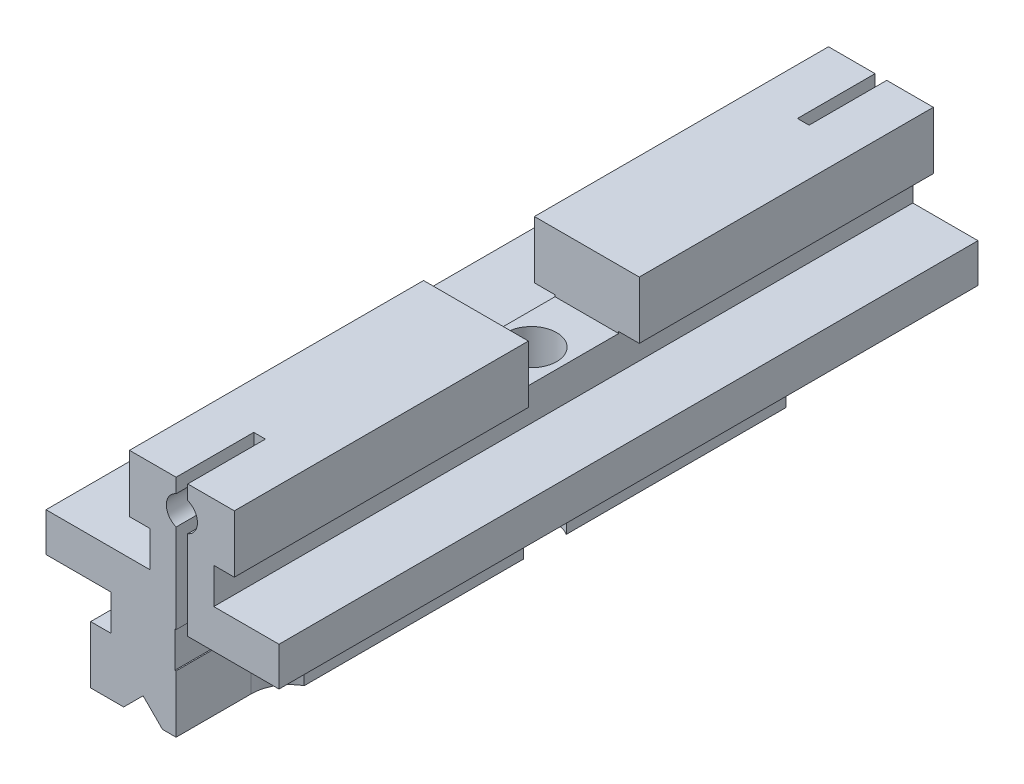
ISO-10303-21;
HEADER;
FILE_DESCRIPTION(('STEP AP214'),'2;1');
FILE_NAME('part.step','',(''),(''),'','','');
FILE_SCHEMA(('AUTOMOTIVE_DESIGN { 1 0 10303 214 1 1 1 1 }'));
ENDSEC;
DATA;
#1=APPLICATION_CONTEXT('core data for automotive mechanical design processes');
#2=APPLICATION_PROTOCOL_DEFINITION('international standard','automotive_design',2000,#1);
#3=PRODUCT_CONTEXT('',#1,'mechanical');
#4=PRODUCT('Part','Part','',(#3));
#5=PRODUCT_RELATED_PRODUCT_CATEGORY('part','',(#4));
#6=PRODUCT_DEFINITION_FORMATION('','',#4);
#7=PRODUCT_DEFINITION_CONTEXT('part definition',#1,'design');
#8=PRODUCT_DEFINITION('design','',#6,#7);
#9=PRODUCT_DEFINITION_SHAPE('','',#8);
#10=(LENGTH_UNIT() NAMED_UNIT(*) SI_UNIT(.MILLI.,.METRE.));
#11=(NAMED_UNIT(*) PLANE_ANGLE_UNIT() SI_UNIT($,.RADIAN.));
#12=(NAMED_UNIT(*) SI_UNIT($,.STERADIAN.) SOLID_ANGLE_UNIT());
#13=UNCERTAINTY_MEASURE_WITH_UNIT(LENGTH_MEASURE(1.E-05),#10,'distance_accuracy_value','');
#14=(GEOMETRIC_REPRESENTATION_CONTEXT(3) GLOBAL_UNCERTAINTY_ASSIGNED_CONTEXT((#13)) GLOBAL_UNIT_ASSIGNED_CONTEXT((#10,
#11,#12)) REPRESENTATION_CONTEXT('',''));
#15=CARTESIAN_POINT('',(0.,0.,0.));
#16=DIRECTION('',(0.,0.,1.));
#17=DIRECTION('',(1.,0.,0.));
#18=AXIS2_PLACEMENT_3D('',#15,#16,#17);
#19=CARTESIAN_POINT('',(5.,13.2999954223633,45.));
#20=DIRECTION('',(0.,0.,-1.));
#21=DIRECTION('',(-1.,0.,0.));
#22=AXIS2_PLACEMENT_3D('',#19,#20,#21);
#23=CYLINDRICAL_SURFACE('',#22,2.);
#24=DIRECTION('',(0.,0.,-1.));
#25=VECTOR('',#24,1.);
#26=CARTESIAN_POINT('',(5.75,11.4459458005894,45.));
#27=LINE('',#26,#25);
#28=CARTESIAN_POINT('',(5.75,11.4459458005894,35.));
#29=VERTEX_POINT('',#28);
#30=CARTESIAN_POINT('',(5.75,11.4459458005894,45.));
#31=VERTEX_POINT('',#30);
#32=EDGE_CURVE('E375',#29,#31,#27,.F.);
#33=ORIENTED_EDGE('',*,*,#32,.T.);
#34=CARTESIAN_POINT('',(5.,13.2999954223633,45.));
#35=DIRECTION('',(0.,0.,-1.));
#36=DIRECTION('',(-1.,0.,0.));
#37=AXIS2_PLACEMENT_3D('',#34,#35,#36);
#38=CIRCLE('',#37,2.);
#39=CARTESIAN_POINT('',(5.75,15.1540450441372,45.));
#40=VERTEX_POINT('',#39);
#41=EDGE_CURVE('E384',#40,#31,#38,.T.);
#42=ORIENTED_EDGE('',*,*,#41,.F.);
#43=DIRECTION('',(0.,0.,-1.));
#44=VECTOR('',#43,1.);
#45=CARTESIAN_POINT('',(5.75,15.1540450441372,45.));
#46=LINE('',#45,#44);
#47=CARTESIAN_POINT('',(5.75,15.1540450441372,35.));
#48=VERTEX_POINT('',#47);
#49=EDGE_CURVE('E380',#40,#48,#46,.T.);
#50=ORIENTED_EDGE('',*,*,#49,.T.);
#51=CARTESIAN_POINT('',(5.,13.2999954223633,35.));
#52=DIRECTION('',(0.,0.,-1.));
#53=DIRECTION('',(-1.,0.,0.));
#54=AXIS2_PLACEMENT_3D('',#51,#52,#53);
#55=CIRCLE('',#54,2.);
#56=EDGE_CURVE('E23',#29,#48,#55,.F.);
#57=ORIENTED_EDGE('',*,*,#56,.F.);
#58=EDGE_LOOP('',(#33,#42,#50,#57));
#59=FACE_BOUND('',#58,.T.);
#60=ADVANCED_FACE('F19',(#59),#23,.F.);
#61=CARTESIAN_POINT('',(11.75,9.59999084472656,0.));
#62=DIRECTION('',(0.,-1.,0.));
#63=DIRECTION('',(0.,0.,-1.));
#64=AXIS2_PLACEMENT_3D('',#61,#62,#63);
#65=PLANE('',#64);
#66=DIRECTION('',(1.,0.,0.));
#67=VECTOR('',#66,1.);
#68=CARTESIAN_POINT('',(2.46334938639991,9.59999084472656,45.));
#69=LINE('',#68,#67);
#70=CARTESIAN_POINT('',(9.10000610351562,9.59999084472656,45.));
#71=VERTEX_POINT('',#70);
#72=CARTESIAN_POINT('',(11.75,9.59999084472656,45.));
#73=VERTEX_POINT('',#72);
#74=EDGE_CURVE('E487',#71,#73,#69,.T.);
#75=ORIENTED_EDGE('',*,*,#74,.F.);
#76=DIRECTION('',(0.,0.,-1.));
#77=VECTOR('',#76,1.);
#78=CARTESIAN_POINT('',(9.10000610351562,9.59999084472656,0.));
#79=LINE('',#78,#77);
#80=CARTESIAN_POINT('',(9.10000610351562,9.59999084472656,7.1374));
#81=VERTEX_POINT('',#80);
#82=EDGE_CURVE('E567',#81,#71,#79,.F.);
#83=ORIENTED_EDGE('',*,*,#82,.F.);
#84=DIRECTION('',(1.,0.,0.));
#85=VECTOR('',#84,1.);
#86=CARTESIAN_POINT('',(-1.75000000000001,9.59999084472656,7.1374));
#87=LINE('',#86,#85);
#88=CARTESIAN_POINT('',(11.75,9.59999084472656,7.1374));
#89=VERTEX_POINT('',#88);
#90=EDGE_CURVE('E554',#81,#89,#87,.T.);
#91=ORIENTED_EDGE('',*,*,#90,.T.);
#92=DIRECTION('',(0.,0.,-1.));
#93=VECTOR('',#92,1.);
#94=CARTESIAN_POINT('',(11.75,9.59999084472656,0.));
#95=LINE('',#94,#93);
#96=EDGE_CURVE('E486',#73,#89,#95,.T.);
#97=ORIENTED_EDGE('',*,*,#96,.F.);
#98=EDGE_LOOP('',(#75,#83,#91,#97));
#99=FACE_BOUND('',#98,.T.);
#100=ADVANCED_FACE('F977',(#99),#65,.T.);
#101=CARTESIAN_POINT('',(9.10000610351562,5.,0.));
#102=DIRECTION('',(0.,1.,0.));
#103=DIRECTION('',(0.,0.,1.));
#104=AXIS2_PLACEMENT_3D('',#101,#102,#103);
#105=PLANE('',#104);
#106=DIRECTION('',(1.,0.,0.));
#107=VECTOR('',#106,1.);
#108=CARTESIAN_POINT('',(2.46334938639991,5.,-45.));
#109=LINE('',#108,#107);
#110=CARTESIAN_POINT('',(17.5,5.,-45.));
#111=VERTEX_POINT('',#110);
#112=CARTESIAN_POINT('',(9.10000610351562,5.,-45.));
#113=VERTEX_POINT('',#112);
#114=EDGE_CURVE('E526',#111,#113,#109,.F.);
#115=ORIENTED_EDGE('',*,*,#114,.T.);
#116=DIRECTION('',(0.,0.,-1.));
#117=VECTOR('',#116,1.);
#118=CARTESIAN_POINT('',(9.10000610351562,5.,0.));
#119=LINE('',#118,#117);
#120=CARTESIAN_POINT('',(9.10000610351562,5.,45.));
#121=VERTEX_POINT('',#120);
#122=EDGE_CURVE('E555',#121,#113,#119,.T.);
#123=ORIENTED_EDGE('',*,*,#122,.F.);
#124=DIRECTION('',(1.,0.,0.));
#125=VECTOR('',#124,1.);
#126=CARTESIAN_POINT('',(2.46334938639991,5.,45.));
#127=LINE('',#126,#125);
#128=CARTESIAN_POINT('',(17.5,5.,45.));
#129=VERTEX_POINT('',#128);
#130=EDGE_CURVE('E490',#129,#121,#127,.F.);
#131=ORIENTED_EDGE('',*,*,#130,.F.);
#132=DIRECTION('',(0.,0.,-1.));
#133=VECTOR('',#132,1.);
#134=CARTESIAN_POINT('',(17.5,5.,0.));
#135=LINE('',#134,#133);
#136=EDGE_CURVE('E534',#111,#129,#135,.F.);
#137=ORIENTED_EDGE('',*,*,#136,.F.);
#138=EDGE_LOOP('',(#115,#123,#131,#137));
#139=FACE_BOUND('',#138,.T.);
#140=ADVANCED_FACE('F1162',(#139),#105,.T.);
#141=CARTESIAN_POINT('',(11.75,9.59999084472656,0.));
#142=DIRECTION('',(0.,-1.,0.));
#143=DIRECTION('',(0.,0.,-1.));
#144=AXIS2_PLACEMENT_3D('',#141,#142,#143);
#145=PLANE('',#144);
#146=DIRECTION('',(1.,0.,0.));
#147=VECTOR('',#146,1.);
#148=CARTESIAN_POINT('',(2.46334938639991,9.59999084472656,-45.));
#149=LINE('',#148,#147);
#150=CARTESIAN_POINT('',(9.10000610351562,9.59999084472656,-45.));
#151=VERTEX_POINT('',#150);
#152=CARTESIAN_POINT('',(11.75,9.59999084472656,-45.));
#153=VERTEX_POINT('',#152);
#154=EDGE_CURVE('E546',#151,#153,#149,.T.);
#155=ORIENTED_EDGE('',*,*,#154,.T.);
#156=DIRECTION('',(0.,0.,-1.));
#157=VECTOR('',#156,1.);
#158=CARTESIAN_POINT('',(11.75,9.59999084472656,0.));
#159=LINE('',#158,#157);
#160=CARTESIAN_POINT('',(11.75,9.59999084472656,-7.1374));
#161=VERTEX_POINT('',#160);
#162=EDGE_CURVE('E527',#161,#153,#159,.T.);
#163=ORIENTED_EDGE('',*,*,#162,.F.);
#164=DIRECTION('',(-1.,0.,0.));
#165=VECTOR('',#164,1.);
#166=CARTESIAN_POINT('',(11.75,9.59999084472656,-7.1374));
#167=LINE('',#166,#165);
#168=CARTESIAN_POINT('',(9.10000610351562,9.59999084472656,-7.1374));
#169=VERTEX_POINT('',#168);
#170=EDGE_CURVE('E542',#161,#169,#167,.T.);
#171=ORIENTED_EDGE('',*,*,#170,.T.);
#172=DIRECTION('',(0.,0.,-1.));
#173=VECTOR('',#172,1.);
#174=CARTESIAN_POINT('',(9.10000610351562,9.59999084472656,0.));
#175=LINE('',#174,#173);
#176=EDGE_CURVE('E551',#151,#169,#175,.F.);
#177=ORIENTED_EDGE('',*,*,#176,.F.);
#178=EDGE_LOOP('',(#155,#163,#171,#177));
#179=FACE_BOUND('',#178,.T.);
#180=ADVANCED_FACE('F1158',(#179),#145,.T.);
#181=CARTESIAN_POINT('',(5.,13.2999954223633,-45.));
#182=DIRECTION('',(0.,0.,1.));
#183=DIRECTION('',(0.,-1.,0.));
#184=AXIS2_PLACEMENT_3D('',#181,#182,#183);
#185=CYLINDRICAL_SURFACE('',#184,2.);
#186=DIRECTION('',(0.,0.,-1.));
#187=VECTOR('',#186,1.);
#188=CARTESIAN_POINT('',(5.75,15.1540450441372,-40.));
#189=LINE('',#188,#187);
#190=CARTESIAN_POINT('',(5.75,15.1540450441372,-35.));
#191=VERTEX_POINT('',#190);
#192=CARTESIAN_POINT('',(5.75,15.1540450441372,-45.));
#193=VERTEX_POINT('',#192);
#194=EDGE_CURVE('E535',#191,#193,#189,.T.);
#195=ORIENTED_EDGE('',*,*,#194,.T.);
#196=CARTESIAN_POINT('',(5.,13.2999954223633,-45.));
#197=DIRECTION('',(0.,0.,1.));
#198=DIRECTION('',(0.,-1.,0.));
#199=AXIS2_PLACEMENT_3D('',#196,#197,#198);
#200=CIRCLE('',#199,2.);
#201=CARTESIAN_POINT('',(5.75,11.4459458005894,-45.));
#202=VERTEX_POINT('',#201);
#203=EDGE_CURVE('E474',#193,#202,#200,.F.);
#204=ORIENTED_EDGE('',*,*,#203,.T.);
#205=DIRECTION('',(0.,0.,1.));
#206=VECTOR('',#205,1.);
#207=CARTESIAN_POINT('',(5.75,11.4459458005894,-40.));
#208=LINE('',#207,#206);
#209=CARTESIAN_POINT('',(5.75,11.4459458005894,-35.));
#210=VERTEX_POINT('',#209);
#211=EDGE_CURVE('E532',#202,#210,#208,.T.);
#212=ORIENTED_EDGE('',*,*,#211,.T.);
#213=CARTESIAN_POINT('',(5.00000000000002,13.2999954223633,-35.));
#214=DIRECTION('',(0.,0.,1.));
#215=DIRECTION('',(0.,-1.,0.));
#216=AXIS2_PLACEMENT_3D('',#213,#214,#215);
#217=CIRCLE('',#216,2.);
#218=EDGE_CURVE('E457',#191,#210,#217,.F.);
#219=ORIENTED_EDGE('',*,*,#218,.F.);
#220=EDGE_LOOP('',(#195,#204,#212,#219));
#221=FACE_BOUND('',#220,.T.);
#222=ADVANCED_FACE('F1161',(#221),#185,.F.);
#223=CARTESIAN_POINT('',(5.75,11.4459458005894,-45.));
#224=DIRECTION('',(1.,0.,0.));
#225=DIRECTION('',(0.,0.,1.));
#226=AXIS2_PLACEMENT_3D('',#223,#224,#225);
#227=PLANE('',#226);
#228=DIRECTION('',(0.,-1.,0.));
#229=VECTOR('',#228,1.);
#230=CARTESIAN_POINT('',(5.75,8.5,-35.));
#231=LINE('',#230,#229);
#232=CARTESIAN_POINT('',(5.75,0.,-35.));
#233=VERTEX_POINT('',#232);
#234=EDGE_CURVE('E456',#210,#233,#231,.T.);
#235=ORIENTED_EDGE('',*,*,#234,.F.);
#236=ORIENTED_EDGE('',*,*,#211,.F.);
#237=DIRECTION('',(0.,1.,0.));
#238=VECTOR('',#237,1.);
#239=CARTESIAN_POINT('',(5.75,2.34999266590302,-45.));
#240=LINE('',#239,#238);
#241=CARTESIAN_POINT('',(5.75,0.,-45.));
#242=VERTEX_POINT('',#241);
#243=EDGE_CURVE('E476',#202,#242,#240,.F.);
#244=ORIENTED_EDGE('',*,*,#243,.T.);
#245=DIRECTION('',(0.,0.,-1.));
#246=VECTOR('',#245,1.);
#247=CARTESIAN_POINT('',(5.75,0.,0.));
#248=LINE('',#247,#246);
#249=EDGE_CURVE('E522',#233,#242,#248,.T.);
#250=ORIENTED_EDGE('',*,*,#249,.F.);
#251=EDGE_LOOP('',(#235,#236,#244,#250));
#252=FACE_BOUND('',#251,.T.);
#253=ADVANCED_FACE('F1009',(#252),#227,.F.);
#254=CARTESIAN_POINT('',(17.5,5.,0.));
#255=DIRECTION('',(1.,0.,0.));
#256=DIRECTION('',(0.,0.,-1.));
#257=AXIS2_PLACEMENT_3D('',#254,#255,#256);
#258=PLANE('',#257);
#259=DIRECTION('',(0.,1.,0.));
#260=VECTOR('',#259,1.);
#261=CARTESIAN_POINT('',(17.5,2.34999266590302,-45.));
#262=LINE('',#261,#260);
#263=CARTESIAN_POINT('',(17.5,0.,-45.));
#264=VERTEX_POINT('',#263);
#265=EDGE_CURVE('E523',#264,#111,#262,.T.);
#266=ORIENTED_EDGE('',*,*,#265,.T.);
#267=ORIENTED_EDGE('',*,*,#136,.T.);
#268=DIRECTION('',(0.,1.,0.));
#269=VECTOR('',#268,1.);
#270=CARTESIAN_POINT('',(17.5,2.34999266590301,45.));
#271=LINE('',#270,#269);
#272=CARTESIAN_POINT('',(17.5,0.,45.));
#273=VERTEX_POINT('',#272);
#274=EDGE_CURVE('E403',#273,#129,#271,.T.);
#275=ORIENTED_EDGE('',*,*,#274,.F.);
#276=DIRECTION('',(0.,0.,-1.));
#277=VECTOR('',#276,1.);
#278=CARTESIAN_POINT('',(17.5,0.,0.));
#279=LINE('',#278,#277);
#280=EDGE_CURVE('E514',#264,#273,#279,.F.);
#281=ORIENTED_EDGE('',*,*,#280,.F.);
#282=EDGE_LOOP('',(#266,#267,#275,#281));
#283=FACE_BOUND('',#282,.T.);
#284=ADVANCED_FACE('F1015',(#283),#258,.T.);
#285=CARTESIAN_POINT('',(5.75,-3.15674724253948,45.));
#286=DIRECTION('',(1.,0.,0.));
#287=DIRECTION('',(0.,0.,-1.));
#288=AXIS2_PLACEMENT_3D('',#285,#286,#287);
#289=PLANE('',#288);
#290=DIRECTION('',(0.,1.,0.));
#291=VECTOR('',#290,1.);
#292=CARTESIAN_POINT('',(5.75,2.34999266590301,45.));
#293=LINE('',#292,#291);
#294=CARTESIAN_POINT('',(5.75,0.,45.));
#295=VERTEX_POINT('',#294);
#296=EDGE_CURVE('E401',#31,#295,#293,.F.);
#297=ORIENTED_EDGE('',*,*,#296,.F.);
#298=ORIENTED_EDGE('',*,*,#32,.F.);
#299=DIRECTION('',(0.,1.,0.));
#300=VECTOR('',#299,1.);
#301=CARTESIAN_POINT('',(5.75,7.21322237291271,35.));
#302=LINE('',#301,#300);
#303=CARTESIAN_POINT('',(5.75,0.,35.));
#304=VERTEX_POINT('',#303);
#305=EDGE_CURVE('E397',#304,#29,#302,.T.);
#306=ORIENTED_EDGE('',*,*,#305,.F.);
#307=DIRECTION('',(0.,0.,-1.));
#308=VECTOR('',#307,1.);
#309=CARTESIAN_POINT('',(5.75,0.,0.));
#310=LINE('',#309,#308);
#311=EDGE_CURVE('E508',#295,#304,#310,.T.);
#312=ORIENTED_EDGE('',*,*,#311,.F.);
#313=EDGE_LOOP('',(#297,#298,#306,#312));
#314=FACE_BOUND('',#313,.T.);
#315=ADVANCED_FACE('F1020',(#314),#289,.F.);
#316=CARTESIAN_POINT('',(5.,7.21322237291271,35.));
#317=DIRECTION('',(0.,0.,1.));
#318=DIRECTION('',(1.,0.,0.));
#319=AXIS2_PLACEMENT_3D('',#316,#317,#318);
#320=PLANE('',#319);
#321=CARTESIAN_POINT('',(5.,13.2999954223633,35.));
#322=DIRECTION('',(0.,0.,-1.));
#323=DIRECTION('',(-1.,0.,0.));
#324=AXIS2_PLACEMENT_3D('',#321,#322,#323);
#325=CIRCLE('',#324,2.);
#326=CARTESIAN_POINT('',(4.24999999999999,15.1540450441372,35.));
#327=VERTEX_POINT('',#326);
#328=CARTESIAN_POINT('',(4.24999999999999,11.4459458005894,35.));
#329=VERTEX_POINT('',#328);
#330=EDGE_CURVE('E448',#327,#329,#325,.F.);
#331=ORIENTED_EDGE('',*,*,#330,.T.);
#332=DIRECTION('',(0.,1.,0.));
#333=VECTOR('',#332,1.);
#334=CARTESIAN_POINT('',(4.24999999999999,11.4459458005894,35.));
#335=LINE('',#334,#333);
#336=CARTESIAN_POINT('',(4.24999999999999,0.,35.));
#337=VERTEX_POINT('',#336);
#338=EDGE_CURVE('E501',#329,#337,#335,.F.);
#339=ORIENTED_EDGE('',*,*,#338,.T.);
#340=DIRECTION('',(1.,0.,0.));
#341=VECTOR('',#340,1.);
#342=CARTESIAN_POINT('',(17.5,0.,35.));
#343=LINE('',#342,#341);
#344=EDGE_CURVE('E505',#304,#337,#343,.F.);
#345=ORIENTED_EDGE('',*,*,#344,.F.);
#346=ORIENTED_EDGE('',*,*,#305,.T.);
#347=ORIENTED_EDGE('',*,*,#56,.T.);
#348=DIRECTION('',(0.,1.,0.));
#349=VECTOR('',#348,1.);
#350=CARTESIAN_POINT('',(5.75,15.1540450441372,35.));
#351=LINE('',#350,#349);
#352=CARTESIAN_POINT('',(5.75,17.,35.));
#353=VERTEX_POINT('',#352);
#354=EDGE_CURVE('E388',#48,#353,#351,.T.);
#355=ORIENTED_EDGE('',*,*,#354,.T.);
#356=DIRECTION('',(1.,0.,0.));
#357=VECTOR('',#356,1.);
#358=CARTESIAN_POINT('',(5.,17.,35.));
#359=LINE('',#358,#357);
#360=CARTESIAN_POINT('',(4.24999999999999,17.,35.));
#361=VERTEX_POINT('',#360);
#362=EDGE_CURVE('E389',#353,#361,#359,.F.);
#363=ORIENTED_EDGE('',*,*,#362,.T.);
#364=DIRECTION('',(0.,1.,0.));
#365=VECTOR('',#364,1.);
#366=CARTESIAN_POINT('',(4.24999999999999,17.,35.));
#367=LINE('',#366,#365);
#368=EDGE_CURVE('E495',#361,#327,#367,.F.);
#369=ORIENTED_EDGE('',*,*,#368,.T.);
#370=EDGE_LOOP('',(#331,#339,#345,#346,#347,#355,#363,#369));
#371=FACE_BOUND('',#370,.T.);
#372=ADVANCED_FACE('F394',(#371),#320,.T.);
#373=CARTESIAN_POINT('',(5.75,15.1540450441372,45.));
#374=DIRECTION('',(1.,0.,0.));
#375=DIRECTION('',(0.,0.,-1.));
#376=AXIS2_PLACEMENT_3D('',#373,#374,#375);
#377=PLANE('',#376);
#378=ORIENTED_EDGE('',*,*,#49,.F.);
#379=DIRECTION('',(0.,1.,0.));
#380=VECTOR('',#379,1.);
#381=CARTESIAN_POINT('',(5.75,2.34999266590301,45.));
#382=LINE('',#381,#380);
#383=CARTESIAN_POINT('',(5.75,17.,45.));
#384=VERTEX_POINT('',#383);
#385=EDGE_CURVE('E483',#384,#40,#382,.F.);
#386=ORIENTED_EDGE('',*,*,#385,.F.);
#387=DIRECTION('',(0.,0.,1.));
#388=VECTOR('',#387,1.);
#389=CARTESIAN_POINT('',(5.75,17.,0.));
#390=LINE('',#389,#388);
#391=EDGE_CURVE('E400',#353,#384,#390,.T.);
#392=ORIENTED_EDGE('',*,*,#391,.F.);
#393=ORIENTED_EDGE('',*,*,#354,.F.);
#394=EDGE_LOOP('',(#378,#386,#392,#393));
#395=FACE_BOUND('',#394,.T.);
#396=ADVANCED_FACE('F398',(#395),#377,.F.);
#397=CARTESIAN_POINT('',(2.46334938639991,2.34999266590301,45.));
#398=DIRECTION('',(0.,0.,1.));
#399=DIRECTION('',(1.,0.,0.));
#400=AXIS2_PLACEMENT_3D('',#397,#398,#399);
#401=PLANE('',#400);
#402=ORIENTED_EDGE('',*,*,#385,.T.);
#403=ORIENTED_EDGE('',*,*,#41,.T.);
#404=ORIENTED_EDGE('',*,*,#296,.T.);
#405=DIRECTION('',(1.,0.,0.));
#406=VECTOR('',#405,1.);
#407=CARTESIAN_POINT('',(17.5,0.,45.));
#408=LINE('',#407,#406);
#409=EDGE_CURVE('E511',#273,#295,#408,.F.);
#410=ORIENTED_EDGE('',*,*,#409,.F.);
#411=ORIENTED_EDGE('',*,*,#274,.T.);
#412=ORIENTED_EDGE('',*,*,#130,.T.);
#413=DIRECTION('',(0.,1.,0.));
#414=VECTOR('',#413,1.);
#415=CARTESIAN_POINT('',(9.10000610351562,9.59999084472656,45.));
#416=LINE('',#415,#414);
#417=EDGE_CURVE('E559',#71,#121,#416,.F.);
#418=ORIENTED_EDGE('',*,*,#417,.F.);
#419=ORIENTED_EDGE('',*,*,#74,.T.);
#420=DIRECTION('',(0.,1.,0.));
#421=VECTOR('',#420,1.);
#422=CARTESIAN_POINT('',(11.75,17.,45.));
#423=LINE('',#422,#421);
#424=CARTESIAN_POINT('',(11.75,17.,45.));
#425=VERTEX_POINT('',#424);
#426=EDGE_CURVE('E482',#425,#73,#423,.F.);
#427=ORIENTED_EDGE('',*,*,#426,.F.);
#428=DIRECTION('',(1.,0.,0.));
#429=VECTOR('',#428,1.);
#430=CARTESIAN_POINT('',(-1.75000000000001,17.,45.));
#431=LINE('',#430,#429);
#432=EDGE_CURVE('E576',#384,#425,#431,.T.);
#433=ORIENTED_EDGE('',*,*,#432,.F.);
#434=EDGE_LOOP('',(#402,#403,#404,#410,#411,#412,#418,#419,#427,#433));
#435=FACE_BOUND('',#434,.T.);
#436=ADVANCED_FACE('F974',(#435),#401,.T.);
#437=CARTESIAN_POINT('',(11.75,17.,0.));
#438=DIRECTION('',(1.,0.,0.));
#439=DIRECTION('',(0.,0.,-1.));
#440=AXIS2_PLACEMENT_3D('',#437,#438,#439);
#441=PLANE('',#440);
#442=ORIENTED_EDGE('',*,*,#426,.T.);
#443=ORIENTED_EDGE('',*,*,#96,.T.);
#444=DIRECTION('',(0.,1.,0.));
#445=VECTOR('',#444,1.);
#446=CARTESIAN_POINT('',(11.75,17.,7.1374));
#447=LINE('',#446,#445);
#448=CARTESIAN_POINT('',(11.75,17.,7.1374));
#449=VERTEX_POINT('',#448);
#450=EDGE_CURVE('E574',#89,#449,#447,.T.);
#451=ORIENTED_EDGE('',*,*,#450,.T.);
#452=DIRECTION('',(0.,0.,1.));
#453=VECTOR('',#452,1.);
#454=CARTESIAN_POINT('',(11.75,17.,0.));
#455=LINE('',#454,#453);
#456=EDGE_CURVE('E579',#425,#449,#455,.F.);
#457=ORIENTED_EDGE('',*,*,#456,.F.);
#458=EDGE_LOOP('',(#442,#443,#451,#457));
#459=FACE_BOUND('',#458,.T.);
#460=ADVANCED_FACE('F973',(#459),#441,.T.);
#461=CARTESIAN_POINT('',(6.75,-4.59999847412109,0.));
#462=DIRECTION('',(1.,0.,0.));
#463=DIRECTION('',(0.,0.,-1.));
#464=AXIS2_PLACEMENT_3D('',#461,#462,#463);
#465=PLANE('',#464);
#466=DIRECTION('',(0.,1.,0.));
#467=VECTOR('',#466,1.);
#468=CARTESIAN_POINT('',(6.75,-12.,31.));
#469=LINE('',#468,#467);
#470=CARTESIAN_POINT('',(6.75,-4.59999847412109,31.));
#471=VERTEX_POINT('',#470);
#472=CARTESIAN_POINT('',(6.75,-12.,31.));
#473=VERTEX_POINT('',#472);
#474=EDGE_CURVE('E583',#471,#473,#469,.F.);
#475=ORIENTED_EDGE('',*,*,#474,.T.);
#476=DIRECTION('',(0.,0.,-1.));
#477=VECTOR('',#476,1.);
#478=CARTESIAN_POINT('',(6.75,-12.,0.));
#479=LINE('',#478,#477);
#480=CARTESIAN_POINT('',(6.75,-12.,2.73861278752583));
#481=VERTEX_POINT('',#480);
#482=EDGE_CURVE('E443',#481,#473,#479,.F.);
#483=ORIENTED_EDGE('',*,*,#482,.F.);
#484=DIRECTION('',(0.,-1.,0.));
#485=VECTOR('',#484,1.);
#486=CARTESIAN_POINT('',(6.75,9.38,2.73861278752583));
#487=LINE('',#486,#485);
#488=CARTESIAN_POINT('',(6.75,-4.59999847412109,2.73861278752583));
#489=VERTEX_POINT('',#488);
#490=EDGE_CURVE('E473',#481,#489,#487,.F.);
#491=ORIENTED_EDGE('',*,*,#490,.T.);
#492=DIRECTION('',(0.,0.,1.));
#493=VECTOR('',#492,1.);
#494=CARTESIAN_POINT('',(6.75,-4.59999847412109,0.));
#495=LINE('',#494,#493);
#496=EDGE_CURVE('E480',#471,#489,#495,.F.);
#497=ORIENTED_EDGE('',*,*,#496,.F.);
#498=EDGE_LOOP('',(#475,#483,#491,#497));
#499=FACE_BOUND('',#498,.T.);
#500=ADVANCED_FACE('F1142',(#499),#465,.T.);
#501=CARTESIAN_POINT('',(9.25,-12.,35.3301270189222));
#502=DIRECTION('',(0.,1.,0.));
#503=DIRECTION('',(0.,0.,1.));
#504=AXIS2_PLACEMENT_3D('',#501,#502,#503);
#505=CYLINDRICAL_SURFACE('',#504,5.);
#506=DIRECTION('',(0.,1.,0.));
#507=VECTOR('',#506,1.);
#508=CARTESIAN_POINT('',(4.25,-12.,35.3301270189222));
#509=LINE('',#508,#507);
#510=CARTESIAN_POINT('',(4.25,-4.59999847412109,35.3301270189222));
#511=VERTEX_POINT('',#510);
#512=CARTESIAN_POINT('',(4.25,-12.,35.3301270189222));
#513=VERTEX_POINT('',#512);
#514=EDGE_CURVE('E442',#511,#513,#509,.F.);
#515=ORIENTED_EDGE('',*,*,#514,.T.);
#516=CARTESIAN_POINT('',(9.25,-12.,35.3301270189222));
#517=DIRECTION('',(0.,1.,0.));
#518=DIRECTION('',(0.,0.,1.));
#519=AXIS2_PLACEMENT_3D('',#516,#517,#518);
#520=CIRCLE('',#519,5.);
#521=EDGE_CURVE('E439',#473,#513,#520,.T.);
#522=ORIENTED_EDGE('',*,*,#521,.F.);
#523=ORIENTED_EDGE('',*,*,#474,.F.);
#524=CARTESIAN_POINT('',(9.25,-4.59999847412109,35.3301270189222));
#525=DIRECTION('',(0.,1.,0.));
#526=DIRECTION('',(0.,0.,1.));
#527=AXIS2_PLACEMENT_3D('',#524,#525,#526);
#528=CIRCLE('',#527,5.);
#529=EDGE_CURVE('E478',#511,#471,#528,.F.);
#530=ORIENTED_EDGE('',*,*,#529,.F.);
#531=EDGE_LOOP('',(#515,#522,#523,#530));
#532=FACE_BOUND('',#531,.T.);
#533=ADVANCED_FACE('F1139',(#532),#505,.F.);
#534=CARTESIAN_POINT('',(4.10000610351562,-4.59999847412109,0.));
#535=DIRECTION('',(0.,1.,0.));
#536=DIRECTION('',(0.,0.,1.));
#537=AXIS2_PLACEMENT_3D('',#534,#535,#536);
#538=PLANE('',#537);
#539=ORIENTED_EDGE('',*,*,#529,.T.);
#540=ORIENTED_EDGE('',*,*,#496,.T.);
#541=CARTESIAN_POINT('',(4.99999999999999,-4.59999847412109,0.));
#542=DIRECTION('',(0.,-1.,0.));
#543=DIRECTION('',(1.,0.,0.));
#544=AXIS2_PLACEMENT_3D('',#541,#542,#543);
#545=CIRCLE('',#544,3.25);
#546=CARTESIAN_POINT('',(4.10000610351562,-4.59999847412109,3.12290105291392));
#547=VERTEX_POINT('',#546);
#548=EDGE_CURVE('E470',#489,#547,#545,.T.);
#549=ORIENTED_EDGE('',*,*,#548,.T.);
#550=DIRECTION('',(0.,0.,-1.));
#551=VECTOR('',#550,1.);
#552=CARTESIAN_POINT('',(4.10000610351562,-4.59999847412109,0.));
#553=LINE('',#552,#551);
#554=CARTESIAN_POINT('',(4.10000610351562,-4.59999847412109,45.));
#555=VERTEX_POINT('',#554);
#556=EDGE_CURVE('E610',#555,#547,#553,.T.);
#557=ORIENTED_EDGE('',*,*,#556,.F.);
#558=DIRECTION('',(1.,0.,0.));
#559=VECTOR('',#558,1.);
#560=CARTESIAN_POINT('',(4.10000610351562,-4.59999847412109,45.));
#561=LINE('',#560,#559);
#562=CARTESIAN_POINT('',(4.25,-4.59999847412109,45.));
#563=VERTEX_POINT('',#562);
#564=EDGE_CURVE('E481',#555,#563,#561,.T.);
#565=ORIENTED_EDGE('',*,*,#564,.T.);
#566=DIRECTION('',(0.,0.,1.));
#567=VECTOR('',#566,1.);
#568=CARTESIAN_POINT('',(4.25,-4.59999847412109,45.));
#569=LINE('',#568,#567);
#570=EDGE_CURVE('E595',#563,#511,#569,.F.);
#571=ORIENTED_EDGE('',*,*,#570,.T.);
#572=EDGE_LOOP('',(#539,#540,#549,#557,#565,#571));
#573=FACE_BOUND('',#572,.T.);
#574=ADVANCED_FACE('F1034',(#573),#538,.T.);
#575=CARTESIAN_POINT('',(9.10000610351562,9.59999084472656,0.));
#576=DIRECTION('',(1.,0.,0.));
#577=DIRECTION('',(0.,0.,-1.));
#578=AXIS2_PLACEMENT_3D('',#575,#576,#577);
#579=PLANE('',#578);
#580=DIRECTION('',(0.,1.,0.));
#581=VECTOR('',#580,1.);
#582=CARTESIAN_POINT('',(9.10000610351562,2.34999266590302,-45.));
#583=LINE('',#582,#581);
#584=EDGE_CURVE('E548',#113,#151,#583,.T.);
#585=ORIENTED_EDGE('',*,*,#584,.T.);
#586=ORIENTED_EDGE('',*,*,#176,.T.);
#587=DIRECTION('',(0.,1.,0.));
#588=VECTOR('',#587,1.);
#589=CARTESIAN_POINT('',(9.10000610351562,17.,-7.1374));
#590=LINE('',#589,#588);
#591=CARTESIAN_POINT('',(9.10000610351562,9.38,-7.1374));
#592=VERTEX_POINT('',#591);
#593=EDGE_CURVE('E544',#169,#592,#590,.F.);
#594=ORIENTED_EDGE('',*,*,#593,.T.);
#595=DIRECTION('',(0.,0.,1.));
#596=VECTOR('',#595,1.);
#597=CARTESIAN_POINT('',(9.10000610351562,9.38,0.));
#598=LINE('',#597,#596);
#599=CARTESIAN_POINT('',(9.10000610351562,9.38,7.1374));
#600=VERTEX_POINT('',#599);
#601=EDGE_CURVE('E743',#600,#592,#598,.F.);
#602=ORIENTED_EDGE('',*,*,#601,.F.);
#603=DIRECTION('',(0.,1.,0.));
#604=VECTOR('',#603,1.);
#605=CARTESIAN_POINT('',(9.10000610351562,17.,7.1374));
#606=LINE('',#605,#604);
#607=EDGE_CURVE('E541',#600,#81,#606,.T.);
#608=ORIENTED_EDGE('',*,*,#607,.T.);
#609=ORIENTED_EDGE('',*,*,#82,.T.);
#610=ORIENTED_EDGE('',*,*,#417,.T.);
#611=ORIENTED_EDGE('',*,*,#122,.T.);
#612=EDGE_LOOP('',(#585,#586,#594,#602,#608,#609,#610,#611));
#613=FACE_BOUND('',#612,.T.);
#614=ADVANCED_FACE('F979',(#613),#579,.T.);
#615=CARTESIAN_POINT('',(-1.75000000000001,17.,7.1374));
#616=DIRECTION('',(0.,0.,1.));
#617=DIRECTION('',(1.,0.,0.));
#618=AXIS2_PLACEMENT_3D('',#615,#616,#617);
#619=PLANE('',#618);
#620=DIRECTION('',(1.,0.,0.));
#621=VECTOR('',#620,1.);
#622=CARTESIAN_POINT('',(5.,9.38,7.1374));
#623=LINE('',#622,#621);
#624=CARTESIAN_POINT('',(0.89999389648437,9.38,7.1374));
#625=VERTEX_POINT('',#624);
#626=EDGE_CURVE('E438',#625,#600,#623,.T.);
#627=ORIENTED_EDGE('',*,*,#626,.F.);
#628=DIRECTION('',(0.,1.,0.));
#629=VECTOR('',#628,1.);
#630=CARTESIAN_POINT('',(0.899993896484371,17.,7.1374));
#631=LINE('',#630,#629);
#632=CARTESIAN_POINT('',(0.899993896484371,9.59999084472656,7.1374));
#633=VERTEX_POINT('',#632);
#634=EDGE_CURVE('E573',#633,#625,#631,.F.);
#635=ORIENTED_EDGE('',*,*,#634,.F.);
#636=DIRECTION('',(1.,0.,0.));
#637=VECTOR('',#636,1.);
#638=CARTESIAN_POINT('',(0.899993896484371,9.59999084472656,7.1374));
#639=LINE('',#638,#637);
#640=CARTESIAN_POINT('',(-1.75000000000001,9.59999084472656,7.1374));
#641=VERTEX_POINT('',#640);
#642=EDGE_CURVE('E617',#641,#633,#639,.T.);
#643=ORIENTED_EDGE('',*,*,#642,.F.);
#644=DIRECTION('',(0.,1.,0.));
#645=VECTOR('',#644,1.);
#646=CARTESIAN_POINT('',(-1.75000000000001,9.59999084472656,7.1374));
#647=LINE('',#646,#645);
#648=CARTESIAN_POINT('',(-1.75000000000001,17.,7.1374));
#649=VERTEX_POINT('',#648);
#650=EDGE_CURVE('E731',#649,#641,#647,.F.);
#651=ORIENTED_EDGE('',*,*,#650,.F.);
#652=DIRECTION('',(1.,0.,0.));
#653=VECTOR('',#652,1.);
#654=CARTESIAN_POINT('',(-1.75000000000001,17.,7.1374));
#655=LINE('',#654,#653);
#656=EDGE_CURVE('E498',#449,#649,#655,.F.);
#657=ORIENTED_EDGE('',*,*,#656,.F.);
#658=ORIENTED_EDGE('',*,*,#450,.F.);
#659=ORIENTED_EDGE('',*,*,#90,.F.);
#660=ORIENTED_EDGE('',*,*,#607,.F.);
#661=EDGE_LOOP('',(#627,#635,#643,#651,#657,#658,#659,#660));
#662=FACE_BOUND('',#661,.T.);
#663=ADVANCED_FACE('F962',(#662),#619,.F.);
#664=CARTESIAN_POINT('',(11.75,17.,0.));
#665=DIRECTION('',(1.,0.,0.));
#666=DIRECTION('',(0.,0.,-1.));
#667=AXIS2_PLACEMENT_3D('',#664,#665,#666);
#668=PLANE('',#667);
#669=DIRECTION('',(0.,1.,0.));
#670=VECTOR('',#669,1.);
#671=CARTESIAN_POINT('',(11.75,2.34999266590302,-45.));
#672=LINE('',#671,#670);
#673=CARTESIAN_POINT('',(11.75,17.,-45.));
#674=VERTEX_POINT('',#673);
#675=EDGE_CURVE('E477',#153,#674,#672,.T.);
#676=ORIENTED_EDGE('',*,*,#675,.T.);
#677=DIRECTION('',(0.,0.,1.));
#678=VECTOR('',#677,1.);
#679=CARTESIAN_POINT('',(11.75,17.,0.));
#680=LINE('',#679,#678);
#681=CARTESIAN_POINT('',(11.75,17.,-7.1374));
#682=VERTEX_POINT('',#681);
#683=EDGE_CURVE('E639',#682,#674,#680,.F.);
#684=ORIENTED_EDGE('',*,*,#683,.F.);
#685=DIRECTION('',(0.,1.,0.));
#686=VECTOR('',#685,1.);
#687=CARTESIAN_POINT('',(11.75,17.,-7.1374));
#688=LINE('',#687,#686);
#689=EDGE_CURVE('E545',#682,#161,#688,.F.);
#690=ORIENTED_EDGE('',*,*,#689,.T.);
#691=ORIENTED_EDGE('',*,*,#162,.T.);
#692=EDGE_LOOP('',(#676,#684,#690,#691));
#693=FACE_BOUND('',#692,.T.);
#694=ADVANCED_FACE('F991',(#693),#668,.T.);
#695=CARTESIAN_POINT('',(2.46334938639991,2.34999266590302,-45.));
#696=DIRECTION('',(0.,0.,1.));
#697=DIRECTION('',(1.,0.,0.));
#698=AXIS2_PLACEMENT_3D('',#695,#696,#697);
#699=PLANE('',#698);
#700=ORIENTED_EDGE('',*,*,#203,.F.);
#701=DIRECTION('',(0.,1.,0.));
#702=VECTOR('',#701,1.);
#703=CARTESIAN_POINT('',(5.75,16.0770225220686,-45.));
#704=LINE('',#703,#702);
#705=CARTESIAN_POINT('',(5.75,17.,-45.));
#706=VERTEX_POINT('',#705);
#707=EDGE_CURVE('E538',#193,#706,#704,.T.);
#708=ORIENTED_EDGE('',*,*,#707,.T.);
#709=DIRECTION('',(1.,0.,0.));
#710=VECTOR('',#709,1.);
#711=CARTESIAN_POINT('',(-1.75000000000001,17.,-45.));
#712=LINE('',#711,#710);
#713=EDGE_CURVE('E644',#674,#706,#712,.F.);
#714=ORIENTED_EDGE('',*,*,#713,.F.);
#715=ORIENTED_EDGE('',*,*,#675,.F.);
#716=ORIENTED_EDGE('',*,*,#154,.F.);
#717=ORIENTED_EDGE('',*,*,#584,.F.);
#718=ORIENTED_EDGE('',*,*,#114,.F.);
#719=ORIENTED_EDGE('',*,*,#265,.F.);
#720=DIRECTION('',(1.,0.,0.));
#721=VECTOR('',#720,1.);
#722=CARTESIAN_POINT('',(17.5,0.,-45.));
#723=LINE('',#722,#721);
#724=EDGE_CURVE('E519',#242,#264,#723,.T.);
#725=ORIENTED_EDGE('',*,*,#724,.F.);
#726=ORIENTED_EDGE('',*,*,#243,.F.);
#727=EDGE_LOOP('',(#700,#708,#714,#715,#716,#717,#718,#719,#725,#726));
#728=FACE_BOUND('',#727,.T.);
#729=ADVANCED_FACE('F996',(#728),#699,.F.);
#730=CARTESIAN_POINT('',(5.75,17.,-45.));
#731=DIRECTION('',(1.,0.,0.));
#732=DIRECTION('',(0.,0.,1.));
#733=AXIS2_PLACEMENT_3D('',#730,#731,#732);
#734=PLANE('',#733);
#735=DIRECTION('',(0.,0.,1.));
#736=VECTOR('',#735,1.);
#737=CARTESIAN_POINT('',(5.75,17.,0.));
#738=LINE('',#737,#736);
#739=CARTESIAN_POINT('',(5.75,17.,-35.));
#740=VERTEX_POINT('',#739);
#741=EDGE_CURVE('E649',#706,#740,#738,.T.);
#742=ORIENTED_EDGE('',*,*,#741,.F.);
#743=ORIENTED_EDGE('',*,*,#707,.F.);
#744=ORIENTED_EDGE('',*,*,#194,.F.);
#745=DIRECTION('',(0.,-1.,0.));
#746=VECTOR('',#745,1.);
#747=CARTESIAN_POINT('',(5.75,8.5,-35.));
#748=LINE('',#747,#746);
#749=EDGE_CURVE('E460',#740,#191,#748,.T.);
#750=ORIENTED_EDGE('',*,*,#749,.F.);
#751=EDGE_LOOP('',(#742,#743,#744,#750));
#752=FACE_BOUND('',#751,.T.);
#753=ADVANCED_FACE('F1001',(#752),#734,.F.);
#754=CARTESIAN_POINT('',(11.75,17.,-7.1374));
#755=DIRECTION('',(0.,0.,-1.));
#756=DIRECTION('',(-1.,0.,0.));
#757=AXIS2_PLACEMENT_3D('',#754,#755,#756);
#758=PLANE('',#757);
#759=ORIENTED_EDGE('',*,*,#170,.F.);
#760=ORIENTED_EDGE('',*,*,#689,.F.);
#761=DIRECTION('',(1.,0.,0.));
#762=VECTOR('',#761,1.);
#763=CARTESIAN_POINT('',(-1.75000000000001,17.,-7.1374));
#764=LINE('',#763,#762);
#765=CARTESIAN_POINT('',(-1.75000000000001,17.,-7.1374));
#766=VERTEX_POINT('',#765);
#767=EDGE_CURVE('E636',#766,#682,#764,.T.);
#768=ORIENTED_EDGE('',*,*,#767,.F.);
#769=DIRECTION('',(0.,1.,0.));
#770=VECTOR('',#769,1.);
#771=CARTESIAN_POINT('',(-1.75000000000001,9.59999084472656,-7.1374));
#772=LINE('',#771,#770);
#773=CARTESIAN_POINT('',(-1.75000000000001,9.59999084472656,-7.1374));
#774=VERTEX_POINT('',#773);
#775=EDGE_CURVE('E625',#774,#766,#772,.T.);
#776=ORIENTED_EDGE('',*,*,#775,.F.);
#777=DIRECTION('',(1.,0.,0.));
#778=VECTOR('',#777,1.);
#779=CARTESIAN_POINT('',(0.899993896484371,9.59999084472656,-7.1374));
#780=LINE('',#779,#778);
#781=CARTESIAN_POINT('',(0.89999389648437,9.59999084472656,-7.1374));
#782=VERTEX_POINT('',#781);
#783=EDGE_CURVE('E632',#782,#774,#780,.F.);
#784=ORIENTED_EDGE('',*,*,#783,.F.);
#785=DIRECTION('',(0.,1.,0.));
#786=VECTOR('',#785,1.);
#787=CARTESIAN_POINT('',(0.899993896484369,17.,-7.1374));
#788=LINE('',#787,#786);
#789=CARTESIAN_POINT('',(0.89999389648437,9.38,-7.1374));
#790=VERTEX_POINT('',#789);
#791=EDGE_CURVE('E635',#790,#782,#788,.T.);
#792=ORIENTED_EDGE('',*,*,#791,.F.);
#793=DIRECTION('',(1.,0.,0.));
#794=VECTOR('',#793,1.);
#795=CARTESIAN_POINT('',(5.,9.38,-7.1374));
#796=LINE('',#795,#794);
#797=EDGE_CURVE('E746',#592,#790,#796,.F.);
#798=ORIENTED_EDGE('',*,*,#797,.F.);
#799=ORIENTED_EDGE('',*,*,#593,.F.);
#800=EDGE_LOOP('',(#759,#760,#768,#776,#784,#792,#798,#799));
#801=FACE_BOUND('',#800,.T.);
#802=ADVANCED_FACE('F987',(#801),#758,.F.);
#803=CARTESIAN_POINT('',(6.75,-4.59999847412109,0.));
#804=DIRECTION('',(1.,0.,0.));
#805=DIRECTION('',(0.,0.,-1.));
#806=AXIS2_PLACEMENT_3D('',#803,#804,#805);
#807=PLANE('',#806);
#808=DIRECTION('',(0.,1.,0.));
#809=VECTOR('',#808,1.);
#810=CARTESIAN_POINT('',(6.75,-8.29999923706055,-31.));
#811=LINE('',#810,#809);
#812=CARTESIAN_POINT('',(6.75,-12.,-31.));
#813=VERTEX_POINT('',#812);
#814=CARTESIAN_POINT('',(6.75,-4.59999847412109,-31.));
#815=VERTEX_POINT('',#814);
#816=EDGE_CURVE('E564',#813,#815,#811,.T.);
#817=ORIENTED_EDGE('',*,*,#816,.T.);
#818=DIRECTION('',(0.,0.,1.));
#819=VECTOR('',#818,1.);
#820=CARTESIAN_POINT('',(6.75,-4.59999847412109,0.));
#821=LINE('',#820,#819);
#822=CARTESIAN_POINT('',(6.75,-4.59999847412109,-2.73861278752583));
#823=VERTEX_POINT('',#822);
#824=EDGE_CURVE('E466',#823,#815,#821,.F.);
#825=ORIENTED_EDGE('',*,*,#824,.F.);
#826=DIRECTION('',(0.,-1.,0.));
#827=VECTOR('',#826,1.);
#828=CARTESIAN_POINT('',(6.75,9.38,-2.73861278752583));
#829=LINE('',#828,#827);
#830=CARTESIAN_POINT('',(6.75,-12.,-2.73861278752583));
#831=VERTEX_POINT('',#830);
#832=EDGE_CURVE('E666',#823,#831,#829,.T.);
#833=ORIENTED_EDGE('',*,*,#832,.T.);
#834=DIRECTION('',(0.,0.,-1.));
#835=VECTOR('',#834,1.);
#836=CARTESIAN_POINT('',(6.75,-12.,0.));
#837=LINE('',#836,#835);
#838=EDGE_CURVE('E420',#813,#831,#837,.F.);
#839=ORIENTED_EDGE('',*,*,#838,.F.);
#840=EDGE_LOOP('',(#817,#825,#833,#839));
#841=FACE_BOUND('',#840,.T.);
#842=ADVANCED_FACE('F1041',(#841),#807,.T.);
#843=CARTESIAN_POINT('',(9.25,-12.,-35.3301270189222));
#844=DIRECTION('',(0.,1.,0.));
#845=DIRECTION('',(0.,0.,1.));
#846=AXIS2_PLACEMENT_3D('',#843,#844,#845);
#847=CYLINDRICAL_SURFACE('',#846,5.);
#848=ORIENTED_EDGE('',*,*,#816,.F.);
#849=CARTESIAN_POINT('',(9.25,-12.,-35.3301270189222));
#850=DIRECTION('',(0.,1.,0.));
#851=DIRECTION('',(0.,0.,1.));
#852=AXIS2_PLACEMENT_3D('',#849,#850,#851);
#853=CIRCLE('',#852,5.);
#854=CARTESIAN_POINT('',(4.25,-12.,-35.3301270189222));
#855=VERTEX_POINT('',#854);
#856=EDGE_CURVE('E417',#855,#813,#853,.T.);
#857=ORIENTED_EDGE('',*,*,#856,.F.);
#858=DIRECTION('',(0.,1.,0.));
#859=VECTOR('',#858,1.);
#860=CARTESIAN_POINT('',(4.25,-8.29999923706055,-35.3301270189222));
#861=LINE('',#860,#859);
#862=CARTESIAN_POINT('',(4.25,-4.59999847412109,-35.3301270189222));
#863=VERTEX_POINT('',#862);
#864=EDGE_CURVE('E678',#855,#863,#861,.T.);
#865=ORIENTED_EDGE('',*,*,#864,.T.);
#866=CARTESIAN_POINT('',(9.25,-4.59999847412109,-35.3301270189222));
#867=DIRECTION('',(0.,1.,0.));
#868=DIRECTION('',(0.,0.,1.));
#869=AXIS2_PLACEMENT_3D('',#866,#867,#868);
#870=CIRCLE('',#869,5.);
#871=EDGE_CURVE('E461',#815,#863,#870,.F.);
#872=ORIENTED_EDGE('',*,*,#871,.F.);
#873=EDGE_LOOP('',(#848,#857,#865,#872));
#874=FACE_BOUND('',#873,.T.);
#875=ADVANCED_FACE('F1044',(#874),#847,.F.);
#876=CARTESIAN_POINT('',(5.,9.38,0.));
#877=DIRECTION('',(0.,-1.,0.));
#878=DIRECTION('',(1.,0.,0.));
#879=AXIS2_PLACEMENT_3D('',#876,#877,#878);
#880=CYLINDRICAL_SURFACE('',#879,3.25);
#881=CARTESIAN_POINT('',(5.,9.37999999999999,0.));
#882=DIRECTION('',(0.,-1.,0.));
#883=DIRECTION('',(1.,0.,0.));
#884=AXIS2_PLACEMENT_3D('',#881,#882,#883);
#885=CIRCLE('',#884,3.25);
#886=CARTESIAN_POINT('',(8.25,9.37999999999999,0.));
#887=VERTEX_POINT('',#886);
#888=EDGE_CURVE('E435',#887,#887,#885,.T.);
#889=ORIENTED_EDGE('',*,*,#888,.F.);
#890=EDGE_LOOP('',(#889));
#891=FACE_BOUND('',#890,.T.);
#892=DIRECTION('',(0.,1.,0.));
#893=VECTOR('',#892,1.);
#894=CARTESIAN_POINT('',(4.10000610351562,0.,3.12290105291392));
#895=LINE('',#894,#893);
#896=CARTESIAN_POINT('',(4.10000610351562,0.,3.12290105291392));
#897=VERTEX_POINT('',#896);
#898=EDGE_CURVE('E603',#547,#897,#895,.T.);
#899=ORIENTED_EDGE('',*,*,#898,.F.);
#900=ORIENTED_EDGE('',*,*,#548,.F.);
#901=ORIENTED_EDGE('',*,*,#490,.F.);
#902=CARTESIAN_POINT('',(4.99999999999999,-12.,0.));
#903=DIRECTION('',(0.,-1.,0.));
#904=DIRECTION('',(1.,0.,0.));
#905=AXIS2_PLACEMENT_3D('',#902,#903,#904);
#906=CIRCLE('',#905,3.25);
#907=CARTESIAN_POINT('',(2.5,-12.,2.07665596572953));
#908=VERTEX_POINT('',#907);
#909=EDGE_CURVE('E444',#908,#481,#906,.F.);
#910=ORIENTED_EDGE('',*,*,#909,.F.);
#911=CARTESIAN_POINT('',(4.99999999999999,-14.5,0.));
#912=DIRECTION('',(-0.707106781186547,-0.707106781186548,0.));
#913=DIRECTION('',(0.707106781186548,-0.707106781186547,0.));
#914=AXIS2_PLACEMENT_3D('',#911,#912,#913);
#915=ELLIPSE('',#914,4.59619407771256,3.25);
#916=CARTESIAN_POINT('',(2.5,-12.,-2.07665596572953));
#917=VERTEX_POINT('',#916);
#918=EDGE_CURVE('E426',#917,#908,#915,.F.);
#919=ORIENTED_EDGE('',*,*,#918,.F.);
#920=CARTESIAN_POINT('',(4.99999999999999,-12.,0.));
#921=DIRECTION('',(0.,-1.,0.));
#922=DIRECTION('',(1.,0.,0.));
#923=AXIS2_PLACEMENT_3D('',#920,#921,#922);
#924=CIRCLE('',#923,3.25);
#925=EDGE_CURVE('E422',#831,#917,#924,.F.);
#926=ORIENTED_EDGE('',*,*,#925,.F.);
#927=ORIENTED_EDGE('',*,*,#832,.F.);
#928=CARTESIAN_POINT('',(4.99999999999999,-4.59999847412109,0.));
#929=DIRECTION('',(0.,-1.,0.));
#930=DIRECTION('',(1.,0.,0.));
#931=AXIS2_PLACEMENT_3D('',#928,#929,#930);
#932=CIRCLE('',#931,3.25);
#933=CARTESIAN_POINT('',(4.10000610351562,-4.59999847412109,-3.12290105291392));
#934=VERTEX_POINT('',#933);
#935=EDGE_CURVE('E467',#934,#823,#932,.T.);
#936=ORIENTED_EDGE('',*,*,#935,.F.);
#937=DIRECTION('',(0.,1.,0.));
#938=VECTOR('',#937,1.);
#939=CARTESIAN_POINT('',(4.10000610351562,0.,-3.12290105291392));
#940=LINE('',#939,#938);
#941=CARTESIAN_POINT('',(4.10000610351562,0.,-3.12290105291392));
#942=VERTEX_POINT('',#941);
#943=EDGE_CURVE('E686',#942,#934,#940,.F.);
#944=ORIENTED_EDGE('',*,*,#943,.F.);
#945=CARTESIAN_POINT('',(4.99999999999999,0.,0.));
#946=DIRECTION('',(0.,-1.,0.));
#947=DIRECTION('',(1.,0.,0.));
#948=AXIS2_PLACEMENT_3D('',#945,#946,#947);
#949=CIRCLE('',#948,3.25);
#950=EDGE_CURVE('E452',#897,#942,#949,.F.);
#951=ORIENTED_EDGE('',*,*,#950,.F.);
#952=EDGE_LOOP('',(#899,#900,#901,#910,#919,#926,#927,#936,#944,#951));
#953=FACE_BOUND('',#952,.T.);
#954=ADVANCED_FACE('F1037',(#891,#953),#880,.F.);
#955=CARTESIAN_POINT('',(4.10000610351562,-4.59999847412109,0.));
#956=DIRECTION('',(0.,1.,0.));
#957=DIRECTION('',(0.,0.,1.));
#958=AXIS2_PLACEMENT_3D('',#955,#956,#957);
#959=PLANE('',#958);
#960=DIRECTION('',(1.,0.,0.));
#961=VECTOR('',#960,1.);
#962=CARTESIAN_POINT('',(4.10000610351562,-4.59999847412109,-45.));
#963=LINE('',#962,#961);
#964=CARTESIAN_POINT('',(4.25,-4.59999847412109,-45.));
#965=VERTEX_POINT('',#964);
#966=CARTESIAN_POINT('',(4.10000610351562,-4.59999847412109,-45.));
#967=VERTEX_POINT('',#966);
#968=EDGE_CURVE('E465',#965,#967,#963,.F.);
#969=ORIENTED_EDGE('',*,*,#968,.T.);
#970=DIRECTION('',(0.,0.,-1.));
#971=VECTOR('',#970,1.);
#972=CARTESIAN_POINT('',(4.10000610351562,-4.59999847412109,0.));
#973=LINE('',#972,#971);
#974=EDGE_CURVE('E690',#934,#967,#973,.T.);
#975=ORIENTED_EDGE('',*,*,#974,.F.);
#976=ORIENTED_EDGE('',*,*,#935,.T.);
#977=ORIENTED_EDGE('',*,*,#824,.T.);
#978=ORIENTED_EDGE('',*,*,#871,.T.);
#979=DIRECTION('',(0.,0.,-1.));
#980=VECTOR('',#979,1.);
#981=CARTESIAN_POINT('',(4.25,-4.59999847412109,-40.1650635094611));
#982=LINE('',#981,#980);
#983=EDGE_CURVE('E682',#863,#965,#982,.T.);
#984=ORIENTED_EDGE('',*,*,#983,.T.);
#985=EDGE_LOOP('',(#969,#975,#976,#977,#978,#984));
#986=FACE_BOUND('',#985,.T.);
#987=ADVANCED_FACE('F915',(#986),#959,.T.);
#988=CARTESIAN_POINT('',(2.96,17.,-35.));
#989=DIRECTION('',(0.,0.,-1.));
#990=DIRECTION('',(1.,0.,0.));
#991=AXIS2_PLACEMENT_3D('',#988,#989,#990);
#992=PLANE('',#991);
#993=ORIENTED_EDGE('',*,*,#218,.T.);
#994=ORIENTED_EDGE('',*,*,#234,.T.);
#995=DIRECTION('',(1.,0.,0.));
#996=VECTOR('',#995,1.);
#997=CARTESIAN_POINT('',(17.5,0.,-35.));
#998=LINE('',#997,#996);
#999=CARTESIAN_POINT('',(4.25,0.,-35.));
#1000=VERTEX_POINT('',#999);
#1001=EDGE_CURVE('E531',#1000,#233,#998,.T.);
#1002=ORIENTED_EDGE('',*,*,#1001,.F.);
#1003=DIRECTION('',(0.,1.,0.));
#1004=VECTOR('',#1003,1.);
#1005=CARTESIAN_POINT('',(4.25,5.72297290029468,-35.));
#1006=LINE('',#1005,#1004);
#1007=CARTESIAN_POINT('',(4.25,11.4459458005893,-35.));
#1008=VERTEX_POINT('',#1007);
#1009=EDGE_CURVE('E703',#1000,#1008,#1006,.T.);
#1010=ORIENTED_EDGE('',*,*,#1009,.T.);
#1011=CARTESIAN_POINT('',(4.99999999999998,13.2999954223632,-35.));
#1012=DIRECTION('',(0.,0.,1.));
#1013=DIRECTION('',(0.,-1.,0.));
#1014=AXIS2_PLACEMENT_3D('',#1011,#1012,#1013);
#1015=CIRCLE('',#1014,2.);
#1016=CARTESIAN_POINT('',(4.24999999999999,15.1540450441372,-35.));
#1017=VERTEX_POINT('',#1016);
#1018=EDGE_CURVE('E431',#1008,#1017,#1015,.F.);
#1019=ORIENTED_EDGE('',*,*,#1018,.T.);
#1020=DIRECTION('',(0.,1.,0.));
#1021=VECTOR('',#1020,1.);
#1022=CARTESIAN_POINT('',(4.24999999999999,16.0770225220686,-35.));
#1023=LINE('',#1022,#1021);
#1024=CARTESIAN_POINT('',(4.24999999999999,17.,-35.));
#1025=VERTEX_POINT('',#1024);
#1026=EDGE_CURVE('E640',#1017,#1025,#1023,.T.);
#1027=ORIENTED_EDGE('',*,*,#1026,.T.);
#1028=DIRECTION('',(1.,0.,0.));
#1029=VECTOR('',#1028,1.);
#1030=CARTESIAN_POINT('',(-1.75000000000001,17.,-35.));
#1031=LINE('',#1030,#1029);
#1032=EDGE_CURVE('E654',#740,#1025,#1031,.F.);
#1033=ORIENTED_EDGE('',*,*,#1032,.F.);
#1034=ORIENTED_EDGE('',*,*,#749,.T.);
#1035=EDGE_LOOP('',(#993,#994,#1002,#1010,#1019,#1027,#1033,#1034));
#1036=FACE_BOUND('',#1035,.T.);
#1037=ADVANCED_FACE('F1004',(#1036),#992,.T.);
#1038=CARTESIAN_POINT('',(17.5,0.,0.));
#1039=DIRECTION('',(0.,-1.,0.));
#1040=DIRECTION('',(0.,0.,-1.));
#1041=AXIS2_PLACEMENT_3D('',#1038,#1039,#1040);
#1042=PLANE('',#1041);
#1043=DIRECTION('',(1.,0.,0.));
#1044=VECTOR('',#1043,1.);
#1045=CARTESIAN_POINT('',(17.5,0.,45.));
#1046=LINE('',#1045,#1044);
#1047=CARTESIAN_POINT('',(4.25,0.,45.));
#1048=VERTEX_POINT('',#1047);
#1049=CARTESIAN_POINT('',(4.10000610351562,0.,45.));
#1050=VERTEX_POINT('',#1049);
#1051=EDGE_CURVE('E504',#1048,#1050,#1046,.F.);
#1052=ORIENTED_EDGE('',*,*,#1051,.T.);
#1053=DIRECTION('',(0.,0.,-1.));
#1054=VECTOR('',#1053,1.);
#1055=CARTESIAN_POINT('',(4.10000610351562,0.,0.));
#1056=LINE('',#1055,#1054);
#1057=EDGE_CURVE('E606',#897,#1050,#1056,.F.);
#1058=ORIENTED_EDGE('',*,*,#1057,.F.);
#1059=ORIENTED_EDGE('',*,*,#950,.T.);
#1060=DIRECTION('',(0.,0.,-1.));
#1061=VECTOR('',#1060,1.);
#1062=CARTESIAN_POINT('',(4.10000610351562,0.,0.));
#1063=LINE('',#1062,#1061);
#1064=CARTESIAN_POINT('',(4.10000610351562,0.,-45.));
#1065=VERTEX_POINT('',#1064);
#1066=EDGE_CURVE('E694',#1065,#942,#1063,.F.);
#1067=ORIENTED_EDGE('',*,*,#1066,.F.);
#1068=DIRECTION('',(1.,0.,0.));
#1069=VECTOR('',#1068,1.);
#1070=CARTESIAN_POINT('',(17.5,0.,-45.));
#1071=LINE('',#1070,#1069);
#1072=CARTESIAN_POINT('',(4.25,0.,-45.));
#1073=VERTEX_POINT('',#1072);
#1074=EDGE_CURVE('E455',#1065,#1073,#1071,.T.);
#1075=ORIENTED_EDGE('',*,*,#1074,.T.);
#1076=DIRECTION('',(0.,0.,1.));
#1077=VECTOR('',#1076,1.);
#1078=CARTESIAN_POINT('',(4.25,0.,-40.));
#1079=LINE('',#1078,#1077);
#1080=EDGE_CURVE('E786',#1073,#1000,#1079,.T.);
#1081=ORIENTED_EDGE('',*,*,#1080,.T.);
#1082=ORIENTED_EDGE('',*,*,#1001,.T.);
#1083=ORIENTED_EDGE('',*,*,#249,.T.);
#1084=ORIENTED_EDGE('',*,*,#724,.T.);
#1085=ORIENTED_EDGE('',*,*,#280,.T.);
#1086=ORIENTED_EDGE('',*,*,#409,.T.);
#1087=ORIENTED_EDGE('',*,*,#311,.T.);
#1088=ORIENTED_EDGE('',*,*,#344,.T.);
#1089=DIRECTION('',(0.,0.,1.));
#1090=VECTOR('',#1089,1.);
#1091=CARTESIAN_POINT('',(4.24999999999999,0.,45.));
#1092=LINE('',#1091,#1090);
#1093=EDGE_CURVE('E503',#337,#1048,#1092,.T.);
#1094=ORIENTED_EDGE('',*,*,#1093,.T.);
#1095=EDGE_LOOP('',(#1052,#1058,#1059,#1067,#1075,#1081,#1082,#1083,#1084,#1085,#1086,#1087,
#1088,#1094));
#1096=FACE_BOUND('',#1095,.T.);
#1097=ADVANCED_FACE('F906',(#1096),#1042,.T.);
#1098=CARTESIAN_POINT('',(4.24999999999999,11.4459458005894,45.));
#1099=DIRECTION('',(-1.,0.,0.));
#1100=DIRECTION('',(0.,0.,1.));
#1101=AXIS2_PLACEMENT_3D('',#1098,#1099,#1100);
#1102=PLANE('',#1101);
#1103=ORIENTED_EDGE('',*,*,#338,.F.);
#1104=DIRECTION('',(0.,0.,-1.));
#1105=VECTOR('',#1104,1.);
#1106=CARTESIAN_POINT('',(4.24999999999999,11.4459458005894,45.));
#1107=LINE('',#1106,#1105);
#1108=CARTESIAN_POINT('',(4.24999999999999,11.4459458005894,45.));
#1109=VERTEX_POINT('',#1108);
#1110=EDGE_CURVE('E451',#329,#1109,#1107,.F.);
#1111=ORIENTED_EDGE('',*,*,#1110,.T.);
#1112=DIRECTION('',(0.,1.,0.));
#1113=VECTOR('',#1112,1.);
#1114=CARTESIAN_POINT('',(4.25,2.34999266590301,45.));
#1115=LINE('',#1114,#1113);
#1116=EDGE_CURVE('E416',#1048,#1109,#1115,.T.);
#1117=ORIENTED_EDGE('',*,*,#1116,.F.);
#1118=ORIENTED_EDGE('',*,*,#1093,.F.);
#1119=EDGE_LOOP('',(#1103,#1111,#1117,#1118));
#1120=FACE_BOUND('',#1119,.T.);
#1121=ADVANCED_FACE('F1023',(#1120),#1102,.F.);
#1122=CARTESIAN_POINT('',(5.,13.2999954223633,45.));
#1123=DIRECTION('',(0.,0.,-1.));
#1124=DIRECTION('',(-1.,0.,0.));
#1125=AXIS2_PLACEMENT_3D('',#1122,#1123,#1124);
#1126=CYLINDRICAL_SURFACE('',#1125,2.);
#1127=DIRECTION('',(0.,0.,1.));
#1128=VECTOR('',#1127,1.);
#1129=CARTESIAN_POINT('',(4.24999999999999,15.1540450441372,45.));
#1130=LINE('',#1129,#1128);
#1131=CARTESIAN_POINT('',(4.24999999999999,15.1540450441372,45.));
#1132=VERTEX_POINT('',#1131);
#1133=EDGE_CURVE('E450',#327,#1132,#1130,.T.);
#1134=ORIENTED_EDGE('',*,*,#1133,.T.);
#1135=CARTESIAN_POINT('',(5.,13.2999954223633,45.));
#1136=DIRECTION('',(0.,0.,-1.));
#1137=DIRECTION('',(-1.,0.,0.));
#1138=AXIS2_PLACEMENT_3D('',#1135,#1136,#1137);
#1139=CIRCLE('',#1138,2.);
#1140=EDGE_CURVE('E412',#1109,#1132,#1139,.T.);
#1141=ORIENTED_EDGE('',*,*,#1140,.F.);
#1142=ORIENTED_EDGE('',*,*,#1110,.F.);
#1143=ORIENTED_EDGE('',*,*,#330,.F.);
#1144=EDGE_LOOP('',(#1134,#1141,#1142,#1143));
#1145=FACE_BOUND('',#1144,.T.);
#1146=ADVANCED_FACE('F1116',(#1145),#1126,.F.);
#1147=CARTESIAN_POINT('',(4.24999999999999,17.,45.));
#1148=DIRECTION('',(-1.,0.,0.));
#1149=DIRECTION('',(0.,0.,1.));
#1150=AXIS2_PLACEMENT_3D('',#1147,#1148,#1149);
#1151=PLANE('',#1150);
#1152=DIRECTION('',(0.,0.,1.));
#1153=VECTOR('',#1152,1.);
#1154=CARTESIAN_POINT('',(4.24999999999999,17.,0.));
#1155=LINE('',#1154,#1153);
#1156=CARTESIAN_POINT('',(4.24999999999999,17.,45.));
#1157=VERTEX_POINT('',#1156);
#1158=EDGE_CURVE('E581',#1157,#361,#1155,.F.);
#1159=ORIENTED_EDGE('',*,*,#1158,.F.);
#1160=DIRECTION('',(0.,1.,0.));
#1161=VECTOR('',#1160,1.);
#1162=CARTESIAN_POINT('',(4.24999999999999,2.34999266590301,45.));
#1163=LINE('',#1162,#1161);
#1164=EDGE_CURVE('E415',#1132,#1157,#1163,.T.);
#1165=ORIENTED_EDGE('',*,*,#1164,.F.);
#1166=ORIENTED_EDGE('',*,*,#1133,.F.);
#1167=ORIENTED_EDGE('',*,*,#368,.F.);
#1168=EDGE_LOOP('',(#1159,#1165,#1166,#1167));
#1169=FACE_BOUND('',#1168,.T.);
#1170=ADVANCED_FACE('F1113',(#1169),#1151,.F.);
#1171=CARTESIAN_POINT('',(-1.75000000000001,17.,0.));
#1172=DIRECTION('',(0.,1.,0.));
#1173=DIRECTION('',(0.,0.,1.));
#1174=AXIS2_PLACEMENT_3D('',#1171,#1172,#1173);
#1175=PLANE('',#1174);
#1176=ORIENTED_EDGE('',*,*,#432,.T.);
#1177=ORIENTED_EDGE('',*,*,#456,.T.);
#1178=ORIENTED_EDGE('',*,*,#656,.T.);
#1179=DIRECTION('',(0.,0.,1.));
#1180=VECTOR('',#1179,1.);
#1181=CARTESIAN_POINT('',(-1.75000000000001,17.,0.));
#1182=LINE('',#1181,#1180);
#1183=CARTESIAN_POINT('',(-1.75000000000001,17.,45.));
#1184=VERTEX_POINT('',#1183);
#1185=EDGE_CURVE('E447',#1184,#649,#1182,.F.);
#1186=ORIENTED_EDGE('',*,*,#1185,.F.);
#1187=DIRECTION('',(1.,0.,0.));
#1188=VECTOR('',#1187,1.);
#1189=CARTESIAN_POINT('',(2.46334938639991,17.,45.));
#1190=LINE('',#1189,#1188);
#1191=EDGE_CURVE('E722',#1157,#1184,#1190,.F.);
#1192=ORIENTED_EDGE('',*,*,#1191,.F.);
#1193=ORIENTED_EDGE('',*,*,#1158,.T.);
#1194=ORIENTED_EDGE('',*,*,#362,.F.);
#1195=ORIENTED_EDGE('',*,*,#391,.T.);
#1196=EDGE_LOOP('',(#1176,#1177,#1178,#1186,#1192,#1193,#1194,#1195));
#1197=FACE_BOUND('',#1196,.T.);
#1198=ADVANCED_FACE('F969',(#1197),#1175,.T.);
#1199=CARTESIAN_POINT('',(-1.75000000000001,9.59999084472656,0.));
#1200=DIRECTION('',(-1.,0.,0.));
#1201=DIRECTION('',(0.,0.,1.));
#1202=AXIS2_PLACEMENT_3D('',#1199,#1200,#1201);
#1203=PLANE('',#1202);
#1204=DIRECTION('',(0.,1.,0.));
#1205=VECTOR('',#1204,1.);
#1206=CARTESIAN_POINT('',(-1.75000000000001,2.34999266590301,45.));
#1207=LINE('',#1206,#1205);
#1208=CARTESIAN_POINT('',(-1.75000000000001,9.59999084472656,45.));
#1209=VERTEX_POINT('',#1208);
#1210=EDGE_CURVE('E725',#1184,#1209,#1207,.F.);
#1211=ORIENTED_EDGE('',*,*,#1210,.F.);
#1212=ORIENTED_EDGE('',*,*,#1185,.T.);
#1213=ORIENTED_EDGE('',*,*,#650,.T.);
#1214=DIRECTION('',(0.,0.,-1.));
#1215=VECTOR('',#1214,1.);
#1216=CARTESIAN_POINT('',(-1.75000000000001,9.59999084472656,0.));
#1217=LINE('',#1216,#1215);
#1218=EDGE_CURVE('E740',#1209,#641,#1217,.T.);
#1219=ORIENTED_EDGE('',*,*,#1218,.F.);
#1220=EDGE_LOOP('',(#1211,#1212,#1213,#1219));
#1221=FACE_BOUND('',#1220,.T.);
#1222=ADVANCED_FACE('F966',(#1221),#1203,.T.);
#1223=CARTESIAN_POINT('',(6.75,-12.,0.));
#1224=DIRECTION('',(0.,-1.,0.));
#1225=DIRECTION('',(0.,0.,-1.));
#1226=AXIS2_PLACEMENT_3D('',#1223,#1224,#1225);
#1227=PLANE('',#1226);
#1228=DIRECTION('',(1.,0.,0.));
#1229=VECTOR('',#1228,1.);
#1230=CARTESIAN_POINT('',(2.46334938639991,-12.,45.));
#1231=LINE('',#1230,#1229);
#1232=CARTESIAN_POINT('',(2.5,-12.,45.));
#1233=VERTEX_POINT('',#1232);
#1234=CARTESIAN_POINT('',(4.25,-12.,45.));
#1235=VERTEX_POINT('',#1234);
#1236=EDGE_CURVE('E600',#1233,#1235,#1231,.T.);
#1237=ORIENTED_EDGE('',*,*,#1236,.F.);
#1238=DIRECTION('',(0.,0.,1.));
#1239=VECTOR('',#1238,1.);
#1240=CARTESIAN_POINT('',(2.5,-12.,0.));
#1241=LINE('',#1240,#1239);
#1242=EDGE_CURVE('E429',#908,#1233,#1241,.T.);
#1243=ORIENTED_EDGE('',*,*,#1242,.F.);
#1244=ORIENTED_EDGE('',*,*,#909,.T.);
#1245=ORIENTED_EDGE('',*,*,#482,.T.);
#1246=ORIENTED_EDGE('',*,*,#521,.T.);
#1247=DIRECTION('',(0.,0.,1.));
#1248=VECTOR('',#1247,1.);
#1249=CARTESIAN_POINT('',(4.25,-12.,45.));
#1250=LINE('',#1249,#1248);
#1251=EDGE_CURVE('E593',#513,#1235,#1250,.T.);
#1252=ORIENTED_EDGE('',*,*,#1251,.T.);
#1253=EDGE_LOOP('',(#1237,#1243,#1244,#1245,#1246,#1252));
#1254=FACE_BOUND('',#1253,.T.);
#1255=ADVANCED_FACE('F1104',(#1254),#1227,.T.);
#1256=CARTESIAN_POINT('',(4.25,-12.,45.));
#1257=DIRECTION('',(-1.,0.,0.));
#1258=DIRECTION('',(0.,0.,1.));
#1259=AXIS2_PLACEMENT_3D('',#1256,#1257,#1258);
#1260=PLANE('',#1259);
#1261=DIRECTION('',(0.,1.,0.));
#1262=VECTOR('',#1261,1.);
#1263=CARTESIAN_POINT('',(4.25,2.34999266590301,45.));
#1264=LINE('',#1263,#1262);
#1265=EDGE_CURVE('E596',#1235,#563,#1264,.T.);
#1266=ORIENTED_EDGE('',*,*,#1265,.F.);
#1267=ORIENTED_EDGE('',*,*,#1251,.F.);
#1268=ORIENTED_EDGE('',*,*,#514,.F.);
#1269=ORIENTED_EDGE('',*,*,#570,.F.);
#1270=EDGE_LOOP('',(#1266,#1267,#1268,#1269));
#1271=FACE_BOUND('',#1270,.T.);
#1272=ADVANCED_FACE('F1101',(#1271),#1260,.F.);
#1273=CARTESIAN_POINT('',(4.10000610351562,0.,0.));
#1274=DIRECTION('',(1.,0.,0.));
#1275=DIRECTION('',(0.,0.,-1.));
#1276=AXIS2_PLACEMENT_3D('',#1273,#1274,#1275);
#1277=PLANE('',#1276);
#1278=DIRECTION('',(0.,1.,0.));
#1279=VECTOR('',#1278,1.);
#1280=CARTESIAN_POINT('',(4.10000610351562,2.34999266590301,45.));
#1281=LINE('',#1280,#1279);
#1282=EDGE_CURVE('E599',#555,#1050,#1281,.T.);
#1283=ORIENTED_EDGE('',*,*,#1282,.F.);
#1284=ORIENTED_EDGE('',*,*,#556,.T.);
#1285=ORIENTED_EDGE('',*,*,#898,.T.);
#1286=ORIENTED_EDGE('',*,*,#1057,.T.);
#1287=EDGE_LOOP('',(#1283,#1284,#1285,#1286));
#1288=FACE_BOUND('',#1287,.T.);
#1289=ADVANCED_FACE('F1028',(#1288),#1277,.T.);
#1290=CARTESIAN_POINT('',(0.899993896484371,9.59999084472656,0.));
#1291=DIRECTION('',(0.,-1.,0.));
#1292=DIRECTION('',(0.,0.,-1.));
#1293=AXIS2_PLACEMENT_3D('',#1290,#1291,#1292);
#1294=PLANE('',#1293);
#1295=DIRECTION('',(1.,0.,0.));
#1296=VECTOR('',#1295,1.);
#1297=CARTESIAN_POINT('',(2.46334938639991,9.59999084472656,45.));
#1298=LINE('',#1297,#1296);
#1299=CARTESIAN_POINT('',(0.899993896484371,9.59999084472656,45.));
#1300=VERTEX_POINT('',#1299);
#1301=EDGE_CURVE('E800',#1209,#1300,#1298,.T.);
#1302=ORIENTED_EDGE('',*,*,#1301,.F.);
#1303=ORIENTED_EDGE('',*,*,#1218,.T.);
#1304=ORIENTED_EDGE('',*,*,#642,.T.);
#1305=DIRECTION('',(0.,0.,1.));
#1306=VECTOR('',#1305,1.);
#1307=CARTESIAN_POINT('',(0.89999389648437,9.59999084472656,0.));
#1308=LINE('',#1307,#1306);
#1309=EDGE_CURVE('E825',#1300,#633,#1308,.F.);
#1310=ORIENTED_EDGE('',*,*,#1309,.F.);
#1311=EDGE_LOOP('',(#1302,#1303,#1304,#1310));
#1312=FACE_BOUND('',#1311,.T.);
#1313=ADVANCED_FACE('F960',(#1312),#1294,.T.);
#1314=CARTESIAN_POINT('',(5.,9.38,0.));
#1315=DIRECTION('',(0.,1.,0.));
#1316=DIRECTION('',(0.,0.,1.));
#1317=AXIS2_PLACEMENT_3D('',#1314,#1315,#1316);
#1318=PLANE('',#1317);
#1319=ORIENTED_EDGE('',*,*,#888,.T.);
#1320=EDGE_LOOP('',(#1319));
#1321=FACE_BOUND('',#1320,.T.);
#1322=DIRECTION('',(0.,0.,1.));
#1323=VECTOR('',#1322,1.);
#1324=CARTESIAN_POINT('',(0.89999389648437,9.38,0.));
#1325=LINE('',#1324,#1323);
#1326=EDGE_CURVE('E411',#625,#790,#1325,.F.);
#1327=ORIENTED_EDGE('',*,*,#1326,.F.);
#1328=ORIENTED_EDGE('',*,*,#626,.T.);
#1329=ORIENTED_EDGE('',*,*,#601,.T.);
#1330=ORIENTED_EDGE('',*,*,#797,.T.);
#1331=EDGE_LOOP('',(#1327,#1328,#1329,#1330));
#1332=FACE_BOUND('',#1331,.T.);
#1333=ADVANCED_FACE('F982',(#1321,#1332),#1318,.T.);
#1334=CARTESIAN_POINT('',(5.,13.2999954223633,-45.));
#1335=DIRECTION('',(0.,0.,1.));
#1336=DIRECTION('',(0.,-1.,0.));
#1337=AXIS2_PLACEMENT_3D('',#1334,#1335,#1336);
#1338=CYLINDRICAL_SURFACE('',#1337,2.);
#1339=DIRECTION('',(0.,0.,-1.));
#1340=VECTOR('',#1339,1.);
#1341=CARTESIAN_POINT('',(4.25,11.4459458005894,-40.));
#1342=LINE('',#1341,#1340);
#1343=CARTESIAN_POINT('',(4.25,11.4459458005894,-45.));
#1344=VERTEX_POINT('',#1343);
#1345=EDGE_CURVE('E712',#1008,#1344,#1342,.T.);
#1346=ORIENTED_EDGE('',*,*,#1345,.T.);
#1347=CARTESIAN_POINT('',(5.,13.2999954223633,-45.));
#1348=DIRECTION('',(0.,0.,1.));
#1349=DIRECTION('',(0.,-1.,0.));
#1350=AXIS2_PLACEMENT_3D('',#1347,#1348,#1349);
#1351=CIRCLE('',#1350,2.);
#1352=CARTESIAN_POINT('',(4.24999999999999,15.1540450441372,-45.));
#1353=VERTEX_POINT('',#1352);
#1354=EDGE_CURVE('E408',#1344,#1353,#1351,.F.);
#1355=ORIENTED_EDGE('',*,*,#1354,.T.);
#1356=DIRECTION('',(0.,0.,1.));
#1357=VECTOR('',#1356,1.);
#1358=CARTESIAN_POINT('',(4.24999999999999,15.1540450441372,-40.));
#1359=LINE('',#1358,#1357);
#1360=EDGE_CURVE('E434',#1353,#1017,#1359,.T.);
#1361=ORIENTED_EDGE('',*,*,#1360,.T.);
#1362=ORIENTED_EDGE('',*,*,#1018,.F.);
#1363=EDGE_LOOP('',(#1346,#1355,#1361,#1362));
#1364=FACE_BOUND('',#1363,.T.);
#1365=ADVANCED_FACE('F897',(#1364),#1338,.F.);
#1366=CARTESIAN_POINT('',(4.24999999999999,17.,-35.));
#1367=DIRECTION('',(-1.,0.,0.));
#1368=DIRECTION('',(0.,0.,-1.));
#1369=AXIS2_PLACEMENT_3D('',#1366,#1367,#1368);
#1370=PLANE('',#1369);
#1371=ORIENTED_EDGE('',*,*,#1360,.F.);
#1372=DIRECTION('',(0.,1.,0.));
#1373=VECTOR('',#1372,1.);
#1374=CARTESIAN_POINT('',(4.24999999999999,2.34999266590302,-45.));
#1375=LINE('',#1374,#1373);
#1376=CARTESIAN_POINT('',(4.24999999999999,17.,-45.));
#1377=VERTEX_POINT('',#1376);
#1378=EDGE_CURVE('E410',#1353,#1377,#1375,.T.);
#1379=ORIENTED_EDGE('',*,*,#1378,.T.);
#1380=DIRECTION('',(0.,0.,1.));
#1381=VECTOR('',#1380,1.);
#1382=CARTESIAN_POINT('',(4.24999999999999,17.,0.));
#1383=LINE('',#1382,#1381);
#1384=EDGE_CURVE('E629',#1025,#1377,#1383,.F.);
#1385=ORIENTED_EDGE('',*,*,#1384,.F.);
#1386=ORIENTED_EDGE('',*,*,#1026,.F.);
#1387=EDGE_LOOP('',(#1371,#1379,#1385,#1386));
#1388=FACE_BOUND('',#1387,.T.);
#1389=ADVANCED_FACE('F894',(#1388),#1370,.F.);
#1390=CARTESIAN_POINT('',(-1.75000000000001,17.,0.));
#1391=DIRECTION('',(0.,1.,0.));
#1392=DIRECTION('',(0.,0.,1.));
#1393=AXIS2_PLACEMENT_3D('',#1390,#1391,#1392);
#1394=PLANE('',#1393);
#1395=DIRECTION('',(1.,0.,0.));
#1396=VECTOR('',#1395,1.);
#1397=CARTESIAN_POINT('',(2.46334938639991,17.,-45.));
#1398=LINE('',#1397,#1396);
#1399=CARTESIAN_POINT('',(-1.75000000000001,17.,-45.));
#1400=VERTEX_POINT('',#1399);
#1401=EDGE_CURVE('E751',#1377,#1400,#1398,.F.);
#1402=ORIENTED_EDGE('',*,*,#1401,.T.);
#1403=DIRECTION('',(0.,0.,1.));
#1404=VECTOR('',#1403,1.);
#1405=CARTESIAN_POINT('',(-1.75000000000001,17.,0.));
#1406=LINE('',#1405,#1404);
#1407=EDGE_CURVE('E628',#766,#1400,#1406,.F.);
#1408=ORIENTED_EDGE('',*,*,#1407,.F.);
#1409=ORIENTED_EDGE('',*,*,#767,.T.);
#1410=ORIENTED_EDGE('',*,*,#683,.T.);
#1411=ORIENTED_EDGE('',*,*,#713,.T.);
#1412=ORIENTED_EDGE('',*,*,#741,.T.);
#1413=ORIENTED_EDGE('',*,*,#1032,.T.);
#1414=ORIENTED_EDGE('',*,*,#1384,.T.);
#1415=EDGE_LOOP('',(#1402,#1408,#1409,#1410,#1411,#1412,#1413,#1414));
#1416=FACE_BOUND('',#1415,.T.);
#1417=ADVANCED_FACE('F888',(#1416),#1394,.T.);
#1418=CARTESIAN_POINT('',(-1.75000000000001,9.59999084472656,0.));
#1419=DIRECTION('',(-1.,0.,0.));
#1420=DIRECTION('',(0.,0.,1.));
#1421=AXIS2_PLACEMENT_3D('',#1418,#1419,#1420);
#1422=PLANE('',#1421);
#1423=DIRECTION('',(0.,1.,0.));
#1424=VECTOR('',#1423,1.);
#1425=CARTESIAN_POINT('',(-1.75000000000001,2.34999266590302,-45.));
#1426=LINE('',#1425,#1424);
#1427=CARTESIAN_POINT('',(-1.75000000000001,9.59999084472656,-45.));
#1428=VERTEX_POINT('',#1427);
#1429=EDGE_CURVE('E753',#1400,#1428,#1426,.F.);
#1430=ORIENTED_EDGE('',*,*,#1429,.T.);
#1431=DIRECTION('',(0.,0.,-1.));
#1432=VECTOR('',#1431,1.);
#1433=CARTESIAN_POINT('',(-1.75000000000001,9.59999084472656,0.));
#1434=LINE('',#1433,#1432);
#1435=EDGE_CURVE('E762',#774,#1428,#1434,.T.);
#1436=ORIENTED_EDGE('',*,*,#1435,.F.);
#1437=ORIENTED_EDGE('',*,*,#775,.T.);
#1438=ORIENTED_EDGE('',*,*,#1407,.T.);
#1439=EDGE_LOOP('',(#1430,#1436,#1437,#1438));
#1440=FACE_BOUND('',#1439,.T.);
#1441=ADVANCED_FACE('F882',(#1440),#1422,.T.);
#1442=CARTESIAN_POINT('',(0.899993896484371,9.59999084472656,0.));
#1443=DIRECTION('',(0.,-1.,0.));
#1444=DIRECTION('',(0.,0.,-1.));
#1445=AXIS2_PLACEMENT_3D('',#1442,#1443,#1444);
#1446=PLANE('',#1445);
#1447=DIRECTION('',(1.,0.,0.));
#1448=VECTOR('',#1447,1.);
#1449=CARTESIAN_POINT('',(2.46334938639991,9.59999084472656,-45.));
#1450=LINE('',#1449,#1448);
#1451=CARTESIAN_POINT('',(0.899993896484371,9.59999084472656,-45.));
#1452=VERTEX_POINT('',#1451);
#1453=EDGE_CURVE('E832',#1428,#1452,#1450,.T.);
#1454=ORIENTED_EDGE('',*,*,#1453,.T.);
#1455=DIRECTION('',(0.,0.,1.));
#1456=VECTOR('',#1455,1.);
#1457=CARTESIAN_POINT('',(0.89999389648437,9.59999084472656,0.));
#1458=LINE('',#1457,#1456);
#1459=EDGE_CURVE('E612',#782,#1452,#1458,.F.);
#1460=ORIENTED_EDGE('',*,*,#1459,.F.);
#1461=ORIENTED_EDGE('',*,*,#783,.T.);
#1462=ORIENTED_EDGE('',*,*,#1435,.T.);
#1463=EDGE_LOOP('',(#1454,#1460,#1461,#1462));
#1464=FACE_BOUND('',#1463,.T.);
#1465=ADVANCED_FACE('F879',(#1464),#1446,.T.);
#1466=CARTESIAN_POINT('',(-4.10000610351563,-4.59999847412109,0.));
#1467=DIRECTION('',(-1.,0.,0.));
#1468=DIRECTION('',(0.,0.,1.));
#1469=AXIS2_PLACEMENT_3D('',#1466,#1467,#1468);
#1470=PLANE('',#1469);
#1471=DIRECTION('',(0.,1.,0.));
#1472=VECTOR('',#1471,1.);
#1473=CARTESIAN_POINT('',(-4.10000610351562,2.34999266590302,-45.));
#1474=LINE('',#1473,#1472);
#1475=CARTESIAN_POINT('',(-4.10000610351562,0.,-45.));
#1476=VERTEX_POINT('',#1475);
#1477=CARTESIAN_POINT('',(-4.10000610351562,-4.59999847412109,-45.));
#1478=VERTEX_POINT('',#1477);
#1479=EDGE_CURVE('E839',#1476,#1478,#1474,.F.);
#1480=ORIENTED_EDGE('',*,*,#1479,.T.);
#1481=DIRECTION('',(0.,0.,1.));
#1482=VECTOR('',#1481,1.);
#1483=CARTESIAN_POINT('',(-4.10000610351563,-4.59999847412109,0.));
#1484=LINE('',#1483,#1482);
#1485=CARTESIAN_POINT('',(-4.10000610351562,-4.59999847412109,45.));
#1486=VERTEX_POINT('',#1485);
#1487=EDGE_CURVE('E766',#1486,#1478,#1484,.F.);
#1488=ORIENTED_EDGE('',*,*,#1487,.F.);
#1489=DIRECTION('',(0.,1.,0.));
#1490=VECTOR('',#1489,1.);
#1491=CARTESIAN_POINT('',(-4.10000610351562,2.34999266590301,45.));
#1492=LINE('',#1491,#1490);
#1493=CARTESIAN_POINT('',(-4.10000610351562,0.,45.));
#1494=VERTEX_POINT('',#1493);
#1495=EDGE_CURVE('E805',#1494,#1486,#1492,.F.);
#1496=ORIENTED_EDGE('',*,*,#1495,.F.);
#1497=DIRECTION('',(0.,0.,-1.));
#1498=VECTOR('',#1497,1.);
#1499=CARTESIAN_POINT('',(-4.10000610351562,0.,0.));
#1500=LINE('',#1499,#1498);
#1501=EDGE_CURVE('E790',#1476,#1494,#1500,.F.);
#1502=ORIENTED_EDGE('',*,*,#1501,.F.);
#1503=EDGE_LOOP('',(#1480,#1488,#1496,#1502));
#1504=FACE_BOUND('',#1503,.T.);
#1505=ADVANCED_FACE('F947',(#1504),#1470,.T.);
#1506=CARTESIAN_POINT('',(-6.75,-4.59999847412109,0.));
#1507=DIRECTION('',(0.,1.,0.));
#1508=DIRECTION('',(0.,0.,1.));
#1509=AXIS2_PLACEMENT_3D('',#1506,#1507,#1508);
#1510=PLANE('',#1509);
#1511=DIRECTION('',(1.,0.,0.));
#1512=VECTOR('',#1511,1.);
#1513=CARTESIAN_POINT('',(2.46334938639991,-4.59999847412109,-45.));
#1514=LINE('',#1513,#1512);
#1515=CARTESIAN_POINT('',(-6.75,-4.59999847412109,-45.));
#1516=VERTEX_POINT('',#1515);
#1517=EDGE_CURVE('E841',#1478,#1516,#1514,.F.);
#1518=ORIENTED_EDGE('',*,*,#1517,.T.);
#1519=DIRECTION('',(0.,0.,1.));
#1520=VECTOR('',#1519,1.);
#1521=CARTESIAN_POINT('',(-6.75,-4.59999847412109,0.));
#1522=LINE('',#1521,#1520);
#1523=CARTESIAN_POINT('',(-6.75,-4.59999847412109,45.));
#1524=VERTEX_POINT('',#1523);
#1525=EDGE_CURVE('E770',#1524,#1516,#1522,.F.);
#1526=ORIENTED_EDGE('',*,*,#1525,.F.);
#1527=DIRECTION('',(1.,0.,0.));
#1528=VECTOR('',#1527,1.);
#1529=CARTESIAN_POINT('',(2.46334938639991,-4.59999847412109,45.));
#1530=LINE('',#1529,#1528);
#1531=EDGE_CURVE('E808',#1486,#1524,#1530,.F.);
#1532=ORIENTED_EDGE('',*,*,#1531,.F.);
#1533=ORIENTED_EDGE('',*,*,#1487,.T.);
#1534=EDGE_LOOP('',(#1518,#1526,#1532,#1533));
#1535=FACE_BOUND('',#1534,.T.);
#1536=ADVANCED_FACE('F944',(#1535),#1510,.T.);
#1537=CARTESIAN_POINT('',(-6.75,-12.,0.));
#1538=DIRECTION('',(-1.,0.,0.));
#1539=DIRECTION('',(0.,0.,1.));
#1540=AXIS2_PLACEMENT_3D('',#1537,#1538,#1539);
#1541=PLANE('',#1540);
#1542=DIRECTION('',(0.,1.,0.));
#1543=VECTOR('',#1542,1.);
#1544=CARTESIAN_POINT('',(-6.75,2.34999266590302,-45.));
#1545=LINE('',#1544,#1543);
#1546=CARTESIAN_POINT('',(-6.75,-12.,-45.));
#1547=VERTEX_POINT('',#1546);
#1548=EDGE_CURVE('E843',#1516,#1547,#1545,.F.);
#1549=ORIENTED_EDGE('',*,*,#1548,.T.);
#1550=DIRECTION('',(0.,0.,-1.));
#1551=VECTOR('',#1550,1.);
#1552=CARTESIAN_POINT('',(-6.75,-12.,0.));
#1553=LINE('',#1552,#1551);
#1554=CARTESIAN_POINT('',(-6.75,-12.,45.));
#1555=VERTEX_POINT('',#1554);
#1556=EDGE_CURVE('E773',#1555,#1547,#1553,.T.);
#1557=ORIENTED_EDGE('',*,*,#1556,.F.);
#1558=DIRECTION('',(0.,1.,0.));
#1559=VECTOR('',#1558,1.);
#1560=CARTESIAN_POINT('',(-6.75,2.34999266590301,45.));
#1561=LINE('',#1560,#1559);
#1562=EDGE_CURVE('E811',#1524,#1555,#1561,.F.);
#1563=ORIENTED_EDGE('',*,*,#1562,.F.);
#1564=ORIENTED_EDGE('',*,*,#1525,.T.);
#1565=EDGE_LOOP('',(#1549,#1557,#1563,#1564));
#1566=FACE_BOUND('',#1565,.T.);
#1567=ADVANCED_FACE('F940',(#1566),#1541,.T.);
#1568=CARTESIAN_POINT('',(-2.5,-12.,0.));
#1569=DIRECTION('',(0.,-1.,0.));
#1570=DIRECTION('',(0.,0.,-1.));
#1571=AXIS2_PLACEMENT_3D('',#1568,#1569,#1570);
#1572=PLANE('',#1571);
#1573=DIRECTION('',(1.,0.,0.));
#1574=VECTOR('',#1573,1.);
#1575=CARTESIAN_POINT('',(2.46334938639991,-12.,-45.));
#1576=LINE('',#1575,#1574);
#1577=CARTESIAN_POINT('',(-2.5,-12.,-45.));
#1578=VERTEX_POINT('',#1577);
#1579=EDGE_CURVE('E845',#1547,#1578,#1576,.T.);
#1580=ORIENTED_EDGE('',*,*,#1579,.T.);
#1581=DIRECTION('',(0.,0.,1.));
#1582=VECTOR('',#1581,1.);
#1583=CARTESIAN_POINT('',(-2.5,-12.,0.));
#1584=LINE('',#1583,#1582);
#1585=CARTESIAN_POINT('',(-2.5,-12.,45.));
#1586=VERTEX_POINT('',#1585);
#1587=EDGE_CURVE('E430',#1586,#1578,#1584,.F.);
#1588=ORIENTED_EDGE('',*,*,#1587,.F.);
#1589=DIRECTION('',(1.,0.,0.));
#1590=VECTOR('',#1589,1.);
#1591=CARTESIAN_POINT('',(2.46334938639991,-12.,45.));
#1592=LINE('',#1591,#1590);
#1593=EDGE_CURVE('E814',#1555,#1586,#1592,.T.);
#1594=ORIENTED_EDGE('',*,*,#1593,.F.);
#1595=ORIENTED_EDGE('',*,*,#1556,.T.);
#1596=EDGE_LOOP('',(#1580,#1588,#1594,#1595));
#1597=FACE_BOUND('',#1596,.T.);
#1598=ADVANCED_FACE('F935',(#1597),#1572,.T.);
#1599=CARTESIAN_POINT('',(0.,-9.5,0.));
#1600=DIRECTION('',(0.707106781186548,-0.707106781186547,0.));
#1601=DIRECTION('',(0.707106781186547,0.707106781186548,0.));
#1602=AXIS2_PLACEMENT_3D('',#1599,#1600,#1601);
#1603=PLANE('',#1602);
#1604=DIRECTION('',(0.707106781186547,0.707106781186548,0.));
#1605=VECTOR('',#1604,1.);
#1606=CARTESIAN_POINT('',(-2.5,-12.,-45.));
#1607=LINE('',#1606,#1605);
#1608=CARTESIAN_POINT('',(0.,-9.5,-45.));
#1609=VERTEX_POINT('',#1608);
#1610=EDGE_CURVE('E671',#1578,#1609,#1607,.T.);
#1611=ORIENTED_EDGE('',*,*,#1610,.T.);
#1612=DIRECTION('',(0.,0.,1.));
#1613=VECTOR('',#1612,1.);
#1614=CARTESIAN_POINT('',(0.,-9.5,0.));
#1615=LINE('',#1614,#1613);
#1616=CARTESIAN_POINT('',(0.,-9.5,45.));
#1617=VERTEX_POINT('',#1616);
#1618=EDGE_CURVE('E425',#1617,#1609,#1615,.F.);
#1619=ORIENTED_EDGE('',*,*,#1618,.F.);
#1620=DIRECTION('',(0.707106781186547,0.707106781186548,0.));
#1621=VECTOR('',#1620,1.);
#1622=CARTESIAN_POINT('',(-2.5,-12.,45.));
#1623=LINE('',#1622,#1621);
#1624=EDGE_CURVE('E663',#1586,#1617,#1623,.T.);
#1625=ORIENTED_EDGE('',*,*,#1624,.F.);
#1626=ORIENTED_EDGE('',*,*,#1587,.T.);
#1627=EDGE_LOOP('',(#1611,#1619,#1625,#1626));
#1628=FACE_BOUND('',#1627,.T.);
#1629=ADVANCED_FACE('F932',(#1628),#1603,.T.);
#1630=CARTESIAN_POINT('',(2.5,-12.,0.));
#1631=DIRECTION('',(-0.707106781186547,-0.707106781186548,0.));
#1632=DIRECTION('',(0.707106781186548,-0.707106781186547,0.));
#1633=AXIS2_PLACEMENT_3D('',#1630,#1631,#1632);
#1634=PLANE('',#1633);
#1635=DIRECTION('',(0.707106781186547,-0.707106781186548,0.));
#1636=VECTOR('',#1635,1.);
#1637=CARTESIAN_POINT('',(0.,-9.5,-45.));
#1638=LINE('',#1637,#1636);
#1639=CARTESIAN_POINT('',(2.5,-12.,-45.));
#1640=VERTEX_POINT('',#1639);
#1641=EDGE_CURVE('E668',#1609,#1640,#1638,.T.);
#1642=ORIENTED_EDGE('',*,*,#1641,.T.);
#1643=DIRECTION('',(0.,0.,-1.));
#1644=VECTOR('',#1643,1.);
#1645=CARTESIAN_POINT('',(2.5,-12.,0.));
#1646=LINE('',#1645,#1644);
#1647=EDGE_CURVE('E421',#917,#1640,#1646,.T.);
#1648=ORIENTED_EDGE('',*,*,#1647,.F.);
#1649=ORIENTED_EDGE('',*,*,#918,.T.);
#1650=ORIENTED_EDGE('',*,*,#1242,.T.);
#1651=DIRECTION('',(0.707106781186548,-0.707106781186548,0.));
#1652=VECTOR('',#1651,1.);
#1653=CARTESIAN_POINT('',(0.,-9.5,45.));
#1654=LINE('',#1653,#1652);
#1655=EDGE_CURVE('E660',#1617,#1233,#1654,.T.);
#1656=ORIENTED_EDGE('',*,*,#1655,.F.);
#1657=ORIENTED_EDGE('',*,*,#1618,.T.);
#1658=EDGE_LOOP('',(#1642,#1648,#1649,#1650,#1656,#1657));
#1659=FACE_BOUND('',#1658,.T.);
#1660=ADVANCED_FACE('F928',(#1659),#1634,.T.);
#1661=CARTESIAN_POINT('',(6.75,-12.,0.));
#1662=DIRECTION('',(0.,-1.,0.));
#1663=DIRECTION('',(0.,0.,-1.));
#1664=AXIS2_PLACEMENT_3D('',#1661,#1662,#1663);
#1665=PLANE('',#1664);
#1666=ORIENTED_EDGE('',*,*,#856,.T.);
#1667=ORIENTED_EDGE('',*,*,#838,.T.);
#1668=ORIENTED_EDGE('',*,*,#925,.T.);
#1669=ORIENTED_EDGE('',*,*,#1647,.T.);
#1670=DIRECTION('',(1.,0.,0.));
#1671=VECTOR('',#1670,1.);
#1672=CARTESIAN_POINT('',(2.46334938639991,-12.,-45.));
#1673=LINE('',#1672,#1671);
#1674=CARTESIAN_POINT('',(4.25,-12.,-45.));
#1675=VERTEX_POINT('',#1674);
#1676=EDGE_CURVE('E670',#1640,#1675,#1673,.T.);
#1677=ORIENTED_EDGE('',*,*,#1676,.T.);
#1678=DIRECTION('',(0.,0.,1.));
#1679=VECTOR('',#1678,1.);
#1680=CARTESIAN_POINT('',(4.25,-12.,-40.1650635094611));
#1681=LINE('',#1680,#1679);
#1682=EDGE_CURVE('E675',#1675,#855,#1681,.T.);
#1683=ORIENTED_EDGE('',*,*,#1682,.T.);
#1684=EDGE_LOOP('',(#1666,#1667,#1668,#1669,#1677,#1683));
#1685=FACE_BOUND('',#1684,.T.);
#1686=ADVANCED_FACE('F922',(#1685),#1665,.T.);
#1687=CARTESIAN_POINT('',(4.25,-4.59999847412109,-35.3301270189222));
#1688=DIRECTION('',(-1.,0.,0.));
#1689=DIRECTION('',(0.,0.,-1.));
#1690=AXIS2_PLACEMENT_3D('',#1687,#1688,#1689);
#1691=PLANE('',#1690);
#1692=ORIENTED_EDGE('',*,*,#864,.F.);
#1693=ORIENTED_EDGE('',*,*,#1682,.F.);
#1694=DIRECTION('',(0.,1.,0.));
#1695=VECTOR('',#1694,1.);
#1696=CARTESIAN_POINT('',(4.25,2.34999266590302,-45.));
#1697=LINE('',#1696,#1695);
#1698=EDGE_CURVE('E674',#1675,#965,#1697,.T.);
#1699=ORIENTED_EDGE('',*,*,#1698,.T.);
#1700=ORIENTED_EDGE('',*,*,#983,.F.);
#1701=EDGE_LOOP('',(#1692,#1693,#1699,#1700));
#1702=FACE_BOUND('',#1701,.T.);
#1703=ADVANCED_FACE('F920',(#1702),#1691,.F.);
#1704=CARTESIAN_POINT('',(4.10000610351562,0.,0.));
#1705=DIRECTION('',(1.,0.,0.));
#1706=DIRECTION('',(0.,0.,-1.));
#1707=AXIS2_PLACEMENT_3D('',#1704,#1705,#1706);
#1708=PLANE('',#1707);
#1709=DIRECTION('',(0.,1.,0.));
#1710=VECTOR('',#1709,1.);
#1711=CARTESIAN_POINT('',(4.10000610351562,2.34999266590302,-45.));
#1712=LINE('',#1711,#1710);
#1713=EDGE_CURVE('E681',#967,#1065,#1712,.T.);
#1714=ORIENTED_EDGE('',*,*,#1713,.T.);
#1715=ORIENTED_EDGE('',*,*,#1066,.T.);
#1716=ORIENTED_EDGE('',*,*,#943,.T.);
#1717=ORIENTED_EDGE('',*,*,#974,.T.);
#1718=EDGE_LOOP('',(#1714,#1715,#1716,#1717));
#1719=FACE_BOUND('',#1718,.T.);
#1720=ADVANCED_FACE('F909',(#1719),#1708,.T.);
#1721=CARTESIAN_POINT('',(4.25,11.4459458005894,-35.));
#1722=DIRECTION('',(-1.,0.,0.));
#1723=DIRECTION('',(0.,0.,-1.));
#1724=AXIS2_PLACEMENT_3D('',#1721,#1722,#1723);
#1725=PLANE('',#1724);
#1726=DIRECTION('',(0.,1.,0.));
#1727=VECTOR('',#1726,1.);
#1728=CARTESIAN_POINT('',(4.25,2.34999266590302,-45.));
#1729=LINE('',#1728,#1727);
#1730=EDGE_CURVE('E699',#1073,#1344,#1729,.T.);
#1731=ORIENTED_EDGE('',*,*,#1730,.T.);
#1732=ORIENTED_EDGE('',*,*,#1345,.F.);
#1733=ORIENTED_EDGE('',*,*,#1009,.F.);
#1734=ORIENTED_EDGE('',*,*,#1080,.F.);
#1735=EDGE_LOOP('',(#1731,#1732,#1733,#1734));
#1736=FACE_BOUND('',#1735,.T.);
#1737=ADVANCED_FACE('F21',(#1736),#1725,.F.);
#1738=CARTESIAN_POINT('',(-4.10000610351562,0.,0.));
#1739=DIRECTION('',(0.,-1.,0.));
#1740=DIRECTION('',(0.,0.,-1.));
#1741=AXIS2_PLACEMENT_3D('',#1738,#1739,#1740);
#1742=PLANE('',#1741);
#1743=DIRECTION('',(1.,0.,0.));
#1744=VECTOR('',#1743,1.);
#1745=CARTESIAN_POINT('',(2.46334938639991,0.,-45.));
#1746=LINE('',#1745,#1744);
#1747=CARTESIAN_POINT('',(-12.5,0.,-45.));
#1748=VERTEX_POINT('',#1747);
#1749=EDGE_CURVE('E836',#1748,#1476,#1746,.T.);
#1750=ORIENTED_EDGE('',*,*,#1749,.T.);
#1751=ORIENTED_EDGE('',*,*,#1501,.T.);
#1752=DIRECTION('',(1.,0.,0.));
#1753=VECTOR('',#1752,1.);
#1754=CARTESIAN_POINT('',(2.46334938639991,0.,45.));
#1755=LINE('',#1754,#1753);
#1756=CARTESIAN_POINT('',(-12.5,0.,45.));
#1757=VERTEX_POINT('',#1756);
#1758=EDGE_CURVE('E802',#1757,#1494,#1755,.T.);
#1759=ORIENTED_EDGE('',*,*,#1758,.F.);
#1760=DIRECTION('',(0.,0.,1.));
#1761=VECTOR('',#1760,1.);
#1762=CARTESIAN_POINT('',(-12.5,0.,0.));
#1763=LINE('',#1762,#1761);
#1764=EDGE_CURVE('E854',#1748,#1757,#1763,.T.);
#1765=ORIENTED_EDGE('',*,*,#1764,.F.);
#1766=EDGE_LOOP('',(#1750,#1751,#1759,#1765));
#1767=FACE_BOUND('',#1766,.T.);
#1768=ADVANCED_FACE('F950',(#1767),#1742,.T.);
#1769=CARTESIAN_POINT('',(2.46334938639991,2.34999266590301,45.));
#1770=DIRECTION('',(0.,0.,1.));
#1771=DIRECTION('',(1.,0.,0.));
#1772=AXIS2_PLACEMENT_3D('',#1769,#1770,#1771);
#1773=PLANE('',#1772);
#1774=ORIENTED_EDGE('',*,*,#1282,.T.);
#1775=ORIENTED_EDGE('',*,*,#1051,.F.);
#1776=ORIENTED_EDGE('',*,*,#1116,.T.);
#1777=ORIENTED_EDGE('',*,*,#1140,.T.);
#1778=ORIENTED_EDGE('',*,*,#1164,.T.);
#1779=ORIENTED_EDGE('',*,*,#1191,.T.);
#1780=ORIENTED_EDGE('',*,*,#1210,.T.);
#1781=ORIENTED_EDGE('',*,*,#1301,.T.);
#1782=DIRECTION('',(0.,1.,0.));
#1783=VECTOR('',#1782,1.);
#1784=CARTESIAN_POINT('',(0.89999389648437,5.,45.));
#1785=LINE('',#1784,#1783);
#1786=CARTESIAN_POINT('',(0.89999389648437,5.,45.));
#1787=VERTEX_POINT('',#1786);
#1788=EDGE_CURVE('E822',#1787,#1300,#1785,.T.);
#1789=ORIENTED_EDGE('',*,*,#1788,.F.);
#1790=DIRECTION('',(1.,0.,0.));
#1791=VECTOR('',#1790,1.);
#1792=CARTESIAN_POINT('',(-12.5,5.,45.));
#1793=LINE('',#1792,#1791);
#1794=CARTESIAN_POINT('',(-12.5,5.,45.));
#1795=VERTEX_POINT('',#1794);
#1796=EDGE_CURVE('E858',#1795,#1787,#1793,.T.);
#1797=ORIENTED_EDGE('',*,*,#1796,.F.);
#1798=DIRECTION('',(0.,1.,0.));
#1799=VECTOR('',#1798,1.);
#1800=CARTESIAN_POINT('',(-12.5,0.,45.));
#1801=LINE('',#1800,#1799);
#1802=EDGE_CURVE('E850',#1757,#1795,#1801,.T.);
#1803=ORIENTED_EDGE('',*,*,#1802,.F.);
#1804=ORIENTED_EDGE('',*,*,#1758,.T.);
#1805=ORIENTED_EDGE('',*,*,#1495,.T.);
#1806=ORIENTED_EDGE('',*,*,#1531,.T.);
#1807=ORIENTED_EDGE('',*,*,#1562,.T.);
#1808=ORIENTED_EDGE('',*,*,#1593,.T.);
#1809=ORIENTED_EDGE('',*,*,#1624,.T.);
#1810=ORIENTED_EDGE('',*,*,#1655,.T.);
#1811=ORIENTED_EDGE('',*,*,#1236,.T.);
#1812=ORIENTED_EDGE('',*,*,#1265,.T.);
#1813=ORIENTED_EDGE('',*,*,#564,.F.);
#1814=EDGE_LOOP('',(#1774,#1775,#1776,#1777,#1778,#1779,#1780,#1781,#1789,#1797,#1803,#1804,
#1805,#1806,#1807,#1808,#1809,#1810,#1811,#1812,#1813));
#1815=FACE_BOUND('',#1814,.T.);
#1816=ADVANCED_FACE('F955',(#1815),#1773,.T.);
#1817=CARTESIAN_POINT('',(0.89999389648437,5.,0.));
#1818=DIRECTION('',(-1.,0.,0.));
#1819=DIRECTION('',(0.,0.,1.));
#1820=AXIS2_PLACEMENT_3D('',#1817,#1818,#1819);
#1821=PLANE('',#1820);
#1822=ORIENTED_EDGE('',*,*,#634,.T.);
#1823=ORIENTED_EDGE('',*,*,#1326,.T.);
#1824=ORIENTED_EDGE('',*,*,#791,.T.);
#1825=ORIENTED_EDGE('',*,*,#1459,.T.);
#1826=DIRECTION('',(0.,1.,0.));
#1827=VECTOR('',#1826,1.);
#1828=CARTESIAN_POINT('',(0.899993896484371,2.34999266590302,-45.));
#1829=LINE('',#1828,#1827);
#1830=CARTESIAN_POINT('',(0.89999389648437,5.,-45.));
#1831=VERTEX_POINT('',#1830);
#1832=EDGE_CURVE('E834',#1452,#1831,#1829,.F.);
#1833=ORIENTED_EDGE('',*,*,#1832,.T.);
#1834=DIRECTION('',(0.,0.,1.));
#1835=VECTOR('',#1834,1.);
#1836=CARTESIAN_POINT('',(0.899993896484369,5.,0.));
#1837=LINE('',#1836,#1835);
#1838=EDGE_CURVE('E862',#1787,#1831,#1837,.F.);
#1839=ORIENTED_EDGE('',*,*,#1838,.F.);
#1840=ORIENTED_EDGE('',*,*,#1788,.T.);
#1841=ORIENTED_EDGE('',*,*,#1309,.T.);
#1842=EDGE_LOOP('',(#1822,#1823,#1824,#1825,#1833,#1839,#1840,#1841));
#1843=FACE_BOUND('',#1842,.T.);
#1844=ADVANCED_FACE('F875',(#1843),#1821,.T.);
#1845=CARTESIAN_POINT('',(2.46334938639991,2.34999266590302,-45.));
#1846=DIRECTION('',(0.,0.,1.));
#1847=DIRECTION('',(1.,0.,0.));
#1848=AXIS2_PLACEMENT_3D('',#1845,#1846,#1847);
#1849=PLANE('',#1848);
#1850=ORIENTED_EDGE('',*,*,#1074,.F.);
#1851=ORIENTED_EDGE('',*,*,#1713,.F.);
#1852=ORIENTED_EDGE('',*,*,#968,.F.);
#1853=ORIENTED_EDGE('',*,*,#1698,.F.);
#1854=ORIENTED_EDGE('',*,*,#1676,.F.);
#1855=ORIENTED_EDGE('',*,*,#1641,.F.);
#1856=ORIENTED_EDGE('',*,*,#1610,.F.);
#1857=ORIENTED_EDGE('',*,*,#1579,.F.);
#1858=ORIENTED_EDGE('',*,*,#1548,.F.);
#1859=ORIENTED_EDGE('',*,*,#1517,.F.);
#1860=ORIENTED_EDGE('',*,*,#1479,.F.);
#1861=ORIENTED_EDGE('',*,*,#1749,.F.);
#1862=DIRECTION('',(0.,1.,0.));
#1863=VECTOR('',#1862,1.);
#1864=CARTESIAN_POINT('',(-12.5,0.,-45.));
#1865=LINE('',#1864,#1863);
#1866=CARTESIAN_POINT('',(-12.5,5.,-45.));
#1867=VERTEX_POINT('',#1866);
#1868=EDGE_CURVE('E38',#1867,#1748,#1865,.F.);
#1869=ORIENTED_EDGE('',*,*,#1868,.F.);
#1870=DIRECTION('',(1.,0.,0.));
#1871=VECTOR('',#1870,1.);
#1872=CARTESIAN_POINT('',(-12.5,5.,-45.));
#1873=LINE('',#1872,#1871);
#1874=EDGE_CURVE('E29',#1831,#1867,#1873,.F.);
#1875=ORIENTED_EDGE('',*,*,#1874,.F.);
#1876=ORIENTED_EDGE('',*,*,#1832,.F.);
#1877=ORIENTED_EDGE('',*,*,#1453,.F.);
#1878=ORIENTED_EDGE('',*,*,#1429,.F.);
#1879=ORIENTED_EDGE('',*,*,#1401,.F.);
#1880=ORIENTED_EDGE('',*,*,#1378,.F.);
#1881=ORIENTED_EDGE('',*,*,#1354,.F.);
#1882=ORIENTED_EDGE('',*,*,#1730,.F.);
#1883=EDGE_LOOP('',(#1850,#1851,#1852,#1853,#1854,#1855,#1856,#1857,#1858,#1859,#1860,#1861,
#1869,#1875,#1876,#1877,#1878,#1879,#1880,#1881,#1882));
#1884=FACE_BOUND('',#1883,.T.);
#1885=ADVANCED_FACE('F871',(#1884),#1849,.F.);
#1886=CARTESIAN_POINT('',(-12.5,0.,0.));
#1887=DIRECTION('',(-1.,0.,0.));
#1888=DIRECTION('',(0.,0.,1.));
#1889=AXIS2_PLACEMENT_3D('',#1886,#1887,#1888);
#1890=PLANE('',#1889);
#1891=ORIENTED_EDGE('',*,*,#1868,.T.);
#1892=ORIENTED_EDGE('',*,*,#1764,.T.);
#1893=ORIENTED_EDGE('',*,*,#1802,.T.);
#1894=DIRECTION('',(0.,0.,1.));
#1895=VECTOR('',#1894,1.);
#1896=CARTESIAN_POINT('',(-12.5,5.,0.));
#1897=LINE('',#1896,#1895);
#1898=EDGE_CURVE('E11',#1867,#1795,#1897,.T.);
#1899=ORIENTED_EDGE('',*,*,#1898,.F.);
#1900=EDGE_LOOP('',(#1891,#1892,#1893,#1899));
#1901=FACE_BOUND('',#1900,.T.);
#1902=ADVANCED_FACE('F953',(#1901),#1890,.T.);
#1903=CARTESIAN_POINT('',(-12.5,5.,0.));
#1904=DIRECTION('',(0.,1.,0.));
#1905=DIRECTION('',(0.,0.,1.));
#1906=AXIS2_PLACEMENT_3D('',#1903,#1904,#1905);
#1907=PLANE('',#1906);
#1908=ORIENTED_EDGE('',*,*,#1874,.T.);
#1909=ORIENTED_EDGE('',*,*,#1898,.T.);
#1910=ORIENTED_EDGE('',*,*,#1796,.T.);
#1911=ORIENTED_EDGE('',*,*,#1838,.T.);
#1912=EDGE_LOOP('',(#1908,#1909,#1910,#1911));
#1913=FACE_BOUND('',#1912,.T.);
#1914=ADVANCED_FACE('F868',(#1913),#1907,.T.);
#1915=CLOSED_SHELL('',(#60,#100,#140,#180,#222,#253,#284,#315,#372,#396,#436,#460,#500,#533,
#574,#614,#663,#694,#729,#753,#802,#842,#875,#954,#987,#1037,#1097,#1121,#1146,#1170,#1198,
#1222,#1255,#1272,#1289,#1313,#1333,#1365,#1389,#1417,#1441,#1465,#1505,#1536,#1567,#1598,#1629,
#1660,#1686,#1703,#1720,#1737,#1768,#1816,#1844,#1885,#1902,#1914));
#1916=MANIFOLD_SOLID_BREP('B1',#1915);
#1917=ADVANCED_BREP_SHAPE_REPRESENTATION('',(#18,#1916),#14);
#1918=SHAPE_DEFINITION_REPRESENTATION(#9,#1917);
ENDSEC;
END-ISO-10303-21;
